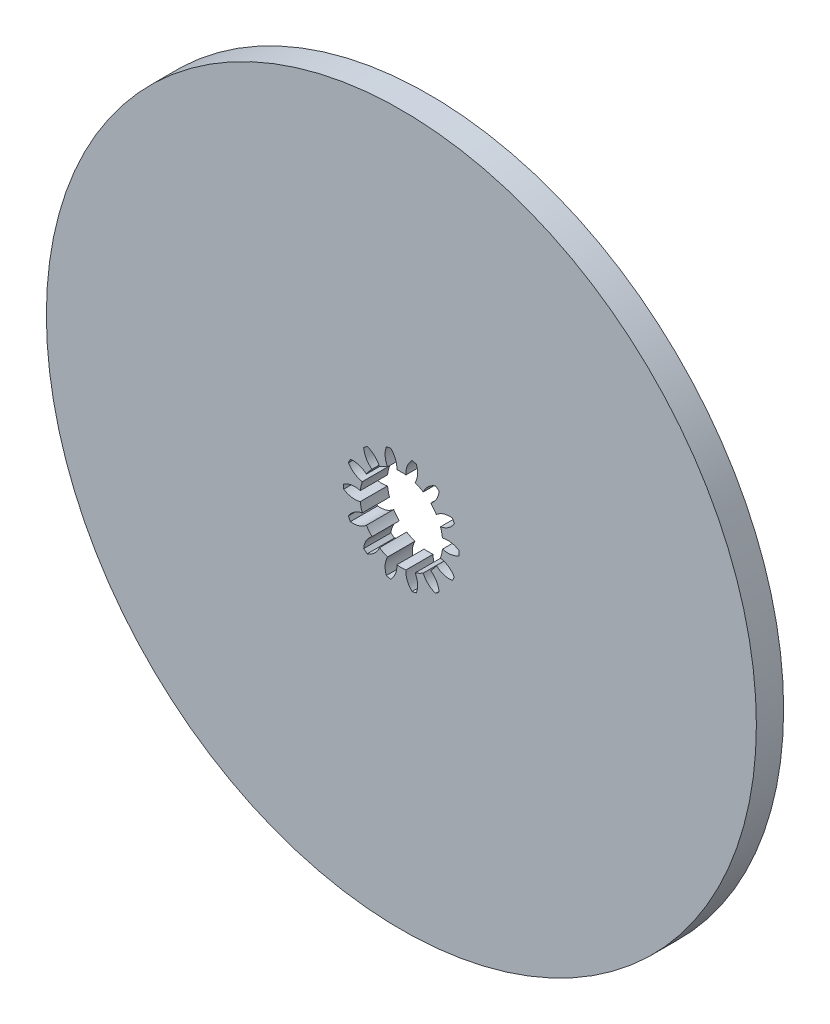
ISO-10303-21;
HEADER;
FILE_DESCRIPTION(('STEP AP214'),'2;1');
FILE_NAME('part.step','',(''),(''),'','','');
FILE_SCHEMA(('AUTOMOTIVE_DESIGN { 1 0 10303 214 1 1 1 1 }'));
ENDSEC;
DATA;
#1=APPLICATION_CONTEXT('core data for automotive mechanical design processes');
#2=APPLICATION_PROTOCOL_DEFINITION('international standard','automotive_design',2000,#1);
#3=PRODUCT_CONTEXT('',#1,'mechanical');
#4=PRODUCT('Part','Part','',(#3));
#5=PRODUCT_RELATED_PRODUCT_CATEGORY('part','',(#4));
#6=PRODUCT_DEFINITION_FORMATION('','',#4);
#7=PRODUCT_DEFINITION_CONTEXT('part definition',#1,'design');
#8=PRODUCT_DEFINITION('design','',#6,#7);
#9=PRODUCT_DEFINITION_SHAPE('','',#8);
#10=(LENGTH_UNIT() NAMED_UNIT(*) SI_UNIT(.MILLI.,.METRE.));
#11=(NAMED_UNIT(*) PLANE_ANGLE_UNIT() SI_UNIT($,.RADIAN.));
#12=(NAMED_UNIT(*) SI_UNIT($,.STERADIAN.) SOLID_ANGLE_UNIT());
#13=UNCERTAINTY_MEASURE_WITH_UNIT(LENGTH_MEASURE(1.E-05),#10,'distance_accuracy_value','');
#14=(GEOMETRIC_REPRESENTATION_CONTEXT(3) GLOBAL_UNCERTAINTY_ASSIGNED_CONTEXT((#13)) GLOBAL_UNIT_ASSIGNED_CONTEXT((#10,
#11,#12)) REPRESENTATION_CONTEXT('',''));
#15=CARTESIAN_POINT('',(0.,0.,0.));
#16=DIRECTION('',(0.,0.,1.));
#17=DIRECTION('',(1.,0.,0.));
#18=AXIS2_PLACEMENT_3D('',#15,#16,#17);
#19=CARTESIAN_POINT('',(0.,0.,-3.));
#20=DIRECTION('',(0.,0.,1.));
#21=DIRECTION('',(1.,0.,0.));
#22=AXIS2_PLACEMENT_3D('',#19,#20,#21);
#23=CYLINDRICAL_SURFACE('',#22,39.06);
#24=CARTESIAN_POINT('',(0.,0.,-3.));
#25=DIRECTION('',(0.,0.,1.));
#26=DIRECTION('',(1.,0.,0.));
#27=AXIS2_PLACEMENT_3D('',#24,#25,#26);
#28=CIRCLE('',#27,39.06);
#29=CARTESIAN_POINT('',(39.06,0.,-3.));
#30=VERTEX_POINT('',#29);
#31=EDGE_CURVE('E11',#30,#30,#28,.T.);
#32=ORIENTED_EDGE('',*,*,#31,.T.);
#33=EDGE_LOOP('',(#32));
#34=FACE_BOUND('',#33,.T.);
#35=CARTESIAN_POINT('',(0.,0.,0.));
#36=DIRECTION('',(0.,0.,1.));
#37=DIRECTION('',(1.,0.,0.));
#38=AXIS2_PLACEMENT_3D('',#35,#36,#37);
#39=CIRCLE('',#38,39.06);
#40=CARTESIAN_POINT('',(39.06,0.,0.));
#41=VERTEX_POINT('',#40);
#42=EDGE_CURVE('E38',#41,#41,#39,.T.);
#43=ORIENTED_EDGE('',*,*,#42,.F.);
#44=EDGE_LOOP('',(#43));
#45=FACE_BOUND('',#44,.T.);
#46=ADVANCED_FACE('F35',(#34,#45),#23,.T.);
#47=CARTESIAN_POINT('',(0.,0.,-3.));
#48=DIRECTION('',(0.,0.,1.));
#49=DIRECTION('',(1.,0.,0.));
#50=AXIS2_PLACEMENT_3D('',#47,#48,#49);
#51=PLANE('',#50);
#52=CARTESIAN_POINT('',(1.93682287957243,-5.01849244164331,-3.));
#53=DIRECTION('',(0.,0.,1.));
#54=DIRECTION('',(1.,0.,0.));
#55=AXIS2_PLACEMENT_3D('',#52,#53,#54);
#56=CIRCLE('',#55,2.2225);
#57=CARTESIAN_POINT('',(4.14922877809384,-4.80691174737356,-3.));
#58=VERTEX_POINT('',#57);
#59=CARTESIAN_POINT('',(3.2287542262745,-3.21006228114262,-3.));
#60=VERTEX_POINT('',#59);
#61=EDGE_CURVE('E395',#58,#60,#56,.T.);
#62=ORIENTED_EDGE('',*,*,#61,.T.);
#63=CARTESIAN_POINT('',(0.,0.,-3.));
#64=DIRECTION('',(0.,0.,1.));
#65=DIRECTION('',(1.,0.,0.));
#66=AXIS2_PLACEMENT_3D('',#63,#64,#65);
#67=CIRCLE('',#66,4.55295);
#68=CARTESIAN_POINT('',(3.84804472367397,-2.43349655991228,-3.));
#69=VERTEX_POINT('',#68);
#70=EDGE_CURVE('E389',#60,#69,#67,.T.);
#71=ORIENTED_EDGE('',*,*,#70,.T.);
#72=CARTESIAN_POINT('',(5.32365199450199,-0.771543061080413,-3.));
#73=DIRECTION('',(0.,0.,1.));
#74=DIRECTION('',(1.,0.,0.));
#75=AXIS2_PLACEMENT_3D('',#72,#73,#74);
#76=CIRCLE('',#75,2.2225);
#77=CARTESIAN_POINT('',(5.60968269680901,-2.97556045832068,-3.));
#78=VERTEX_POINT('',#77);
#79=EDGE_CURVE('E398',#69,#78,#76,.T.);
#80=ORIENTED_EDGE('',*,*,#79,.T.);
#81=CARTESIAN_POINT('',(0.,0.,-3.));
#82=DIRECTION('',(0.,0.,1.));
#83=DIRECTION('',(1.,0.,0.));
#84=AXIS2_PLACEMENT_3D('',#81,#82,#83);
#85=CIRCLE('',#84,6.35);
#86=CARTESIAN_POINT('',(5.8239667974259,-2.53059493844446,-3.));
#87=VERTEX_POINT('',#86);
#88=EDGE_CURVE('E49',#78,#87,#85,.T.);
#89=ORIENTED_EDGE('',*,*,#88,.T.);
#90=CARTESIAN_POINT('',(3.92245938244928,-3.6811495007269,-3.));
#91=DIRECTION('',(0.,0.,1.));
#92=DIRECTION('',(1.,0.,0.));
#93=AXIS2_PLACEMENT_3D('',#90,#91,#92);
#94=CIRCLE('',#93,2.2225);
#95=CARTESIAN_POINT('',(4.30180086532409,-1.49126222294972,-3.));
#96=VERTEX_POINT('',#95);
#97=EDGE_CURVE('E413',#87,#96,#94,.T.);
#98=ORIENTED_EDGE('',*,*,#97,.T.);
#99=CARTESIAN_POINT('',(0.,0.,-3.));
#100=DIRECTION('',(0.,0.,1.));
#101=DIRECTION('',(1.,0.,0.));
#102=AXIS2_PLACEMENT_3D('',#99,#100,#101);
#103=CIRCLE('',#102,4.55295);
#104=CARTESIAN_POINT('',(4.52282308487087,-0.522900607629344,-3.));
#105=VERTEX_POINT('',#104);
#106=EDGE_CURVE('E416',#96,#105,#103,.T.);
#107=ORIENTED_EDGE('',*,*,#106,.T.);
#108=CARTESIAN_POINT('',(5.13120469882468,1.61470975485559,-3.));
#109=DIRECTION('',(0.,0.,1.));
#110=DIRECTION('',(1.,0.,0.));
#111=AXIS2_PLACEMENT_3D('',#108,#109,#110);
#112=CIRCLE('',#111,2.2225);
#113=CARTESIAN_POINT('',(6.34519676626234,-0.246937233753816,-3.));
#114=VERTEX_POINT('',#113);
#115=EDGE_CURVE('E419',#105,#114,#112,.T.);
#116=ORIENTED_EDGE('',*,*,#115,.T.);
#117=CARTESIAN_POINT('',(0.,0.,-3.));
#118=DIRECTION('',(0.,0.,1.));
#119=DIRECTION('',(1.,0.,0.));
#120=AXIS2_PLACEMENT_3D('',#117,#118,#119);
#121=CIRCLE('',#120,6.35);
#122=CARTESIAN_POINT('',(6.34519676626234,0.246937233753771,-3.));
#123=VERTEX_POINT('',#122);
#124=EDGE_CURVE('E422',#114,#123,#121,.T.);
#125=ORIENTED_EDGE('',*,*,#124,.T.);
#126=CARTESIAN_POINT('',(5.13120469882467,-1.61470975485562,-3.));
#127=DIRECTION('',(0.,0.,1.));
#128=DIRECTION('',(1.,0.,0.));
#129=AXIS2_PLACEMENT_3D('',#126,#127,#128);
#130=CIRCLE('',#129,2.2225);
#131=CARTESIAN_POINT('',(4.52282308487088,0.522900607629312,-3.));
#132=VERTEX_POINT('',#131);
#133=EDGE_CURVE('E425',#123,#132,#130,.T.);
#134=ORIENTED_EDGE('',*,*,#133,.T.);
#135=CARTESIAN_POINT('',(0.,0.,-3.));
#136=DIRECTION('',(0.,0.,1.));
#137=DIRECTION('',(1.,0.,0.));
#138=AXIS2_PLACEMENT_3D('',#135,#136,#137);
#139=CIRCLE('',#138,4.55295);
#140=CARTESIAN_POINT('',(4.3018008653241,1.49126222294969,-3.));
#141=VERTEX_POINT('',#140);
#142=EDGE_CURVE('E428',#132,#141,#139,.T.);
#143=ORIENTED_EDGE('',*,*,#142,.T.);
#144=CARTESIAN_POINT('',(3.92245938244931,3.68114950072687,-3.));
#145=DIRECTION('',(0.,0.,1.));
#146=DIRECTION('',(1.,0.,0.));
#147=AXIS2_PLACEMENT_3D('',#144,#145,#146);
#148=CIRCLE('',#147,2.2225);
#149=CARTESIAN_POINT('',(5.82396679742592,2.53059493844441,-3.));
#150=VERTEX_POINT('',#149);
#151=EDGE_CURVE('E431',#141,#150,#148,.T.);
#152=ORIENTED_EDGE('',*,*,#151,.T.);
#153=CARTESIAN_POINT('',(0.,0.,-3.));
#154=DIRECTION('',(0.,0.,1.));
#155=DIRECTION('',(1.,0.,0.));
#156=AXIS2_PLACEMENT_3D('',#153,#154,#155);
#157=CIRCLE('',#156,6.35);
#158=CARTESIAN_POINT('',(5.60968269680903,2.97556045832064,-3.));
#159=VERTEX_POINT('',#158);
#160=EDGE_CURVE('E434',#150,#159,#157,.T.);
#161=ORIENTED_EDGE('',*,*,#160,.T.);
#162=CARTESIAN_POINT('',(5.32365199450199,0.771543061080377,-3.));
#163=DIRECTION('',(0.,0.,1.));
#164=DIRECTION('',(1.,0.,0.));
#165=AXIS2_PLACEMENT_3D('',#162,#163,#164);
#166=CIRCLE('',#165,2.2225);
#167=CARTESIAN_POINT('',(3.84804472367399,2.43349655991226,-3.));
#168=VERTEX_POINT('',#167);
#169=EDGE_CURVE('E437',#159,#168,#166,.T.);
#170=ORIENTED_EDGE('',*,*,#169,.T.);
#171=CARTESIAN_POINT('',(0.,0.,-3.));
#172=DIRECTION('',(0.,0.,1.));
#173=DIRECTION('',(1.,0.,0.));
#174=AXIS2_PLACEMENT_3D('',#171,#172,#173);
#175=CIRCLE('',#174,4.55295);
#176=CARTESIAN_POINT('',(3.22875422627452,3.2100622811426,-3.));
#177=VERTEX_POINT('',#176);
#178=EDGE_CURVE('E440',#168,#177,#175,.T.);
#179=ORIENTED_EDGE('',*,*,#178,.T.);
#180=CARTESIAN_POINT('',(1.93682287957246,5.0184924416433,-3.));
#181=DIRECTION('',(0.,0.,1.));
#182=DIRECTION('',(1.,0.,0.));
#183=AXIS2_PLACEMENT_3D('',#180,#181,#182);
#184=CIRCLE('',#183,2.2225);
#185=CARTESIAN_POINT('',(4.14922877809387,4.80691174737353,-3.));
#186=VERTEX_POINT('',#185);
#187=EDGE_CURVE('E443',#177,#186,#184,.T.);
#188=ORIENTED_EDGE('',*,*,#187,.T.);
#189=CARTESIAN_POINT('',(0.,0.,-3.));
#190=DIRECTION('',(0.,0.,1.));
#191=DIRECTION('',(1.,0.,0.));
#192=AXIS2_PLACEMENT_3D('',#189,#190,#191);
#193=CIRCLE('',#192,6.35);
#194=CARTESIAN_POINT('',(3.76310217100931,5.11483744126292,-3.));
#195=VERTEX_POINT('',#194);
#196=EDGE_CURVE('E446',#186,#195,#193,.T.);
#197=ORIENTED_EDGE('',*,*,#196,.T.);
#198=CARTESIAN_POINT('',(4.46168472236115,3.00498231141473,-3.));
#199=DIRECTION('',(0.,0.,1.));
#200=DIRECTION('',(1.,0.,0.));
#201=AXIS2_PLACEMENT_3D('',#198,#199,#200);
#202=CIRCLE('',#201,2.2225);
#203=CARTESIAN_POINT('',(2.41111391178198,3.86210867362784,-3.));
#204=VERTEX_POINT('',#203);
#205=EDGE_CURVE('E449',#195,#204,#202,.T.);
#206=ORIENTED_EDGE('',*,*,#205,.T.);
#207=CARTESIAN_POINT('',(0.,0.,-3.));
#208=DIRECTION('',(0.,0.,1.));
#209=DIRECTION('',(1.,0.,0.));
#210=AXIS2_PLACEMENT_3D('',#207,#208,#209);
#211=CIRCLE('',#210,4.55295);
#212=CARTESIAN_POINT('',(1.51621321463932,4.29307013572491,-3.));
#213=VERTEX_POINT('',#212);
#214=EDGE_CURVE('E452',#204,#213,#211,.T.);
#215=ORIENTED_EDGE('',*,*,#214,.T.);
#216=CARTESIAN_POINT('',(-0.432425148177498,5.36186140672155,-3.));
#217=DIRECTION('',(0.,0.,1.));
#218=DIRECTION('',(1.,0.,0.));
#219=AXIS2_PLACEMENT_3D('',#216,#217,#218);
#220=CIRCLE('',#219,2.2225);
#221=CARTESIAN_POINT('',(1.65268511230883,6.13116073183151,-3.));
#222=VERTEX_POINT('',#221);
#223=EDGE_CURVE('E455',#213,#222,#220,.T.);
#224=ORIENTED_EDGE('',*,*,#223,.T.);
#225=CARTESIAN_POINT('',(0.,0.,-3.));
#226=DIRECTION('',(0.,0.,1.));
#227=DIRECTION('',(1.,0.,0.));
#228=AXIS2_PLACEMENT_3D('',#225,#226,#227);
#229=CIRCLE('',#228,6.35);
#230=CARTESIAN_POINT('',(1.17119310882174,6.24105813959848,-3.));
#231=VERTEX_POINT('',#230);
#232=EDGE_CURVE('E458',#222,#231,#229,.T.);
#233=ORIENTED_EDGE('',*,*,#232,.T.);
#234=CARTESIAN_POINT('',(2.7160260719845,4.64324796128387,-3.));
#235=DIRECTION('',(0.,0.,1.));
#236=DIRECTION('',(1.,0.,0.));
#237=AXIS2_PLACEMENT_3D('',#234,#235,#236);
#238=CIRCLE('',#237,2.2225);
#239=CARTESIAN_POINT('',(0.49663241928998,4.52578279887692,-3.));
#240=VERTEX_POINT('',#239);
#241=EDGE_CURVE('E461',#231,#240,#238,.T.);
#242=ORIENTED_EDGE('',*,*,#241,.T.);
#243=CARTESIAN_POINT('',(0.,0.,-3.));
#244=DIRECTION('',(0.,0.,1.));
#245=DIRECTION('',(1.,0.,0.));
#246=AXIS2_PLACEMENT_3D('',#243,#244,#245);
#247=CIRCLE('',#246,4.55295);
#248=CARTESIAN_POINT('',(-0.496632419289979,4.52578279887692,-3.));
#249=VERTEX_POINT('',#248);
#250=EDGE_CURVE('E464',#240,#249,#247,.T.);
#251=ORIENTED_EDGE('',*,*,#250,.T.);
#252=CARTESIAN_POINT('',(-2.7160260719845,4.64324796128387,-3.));
#253=DIRECTION('',(0.,0.,1.));
#254=DIRECTION('',(1.,0.,0.));
#255=AXIS2_PLACEMENT_3D('',#252,#253,#254);
#256=CIRCLE('',#255,2.2225);
#257=CARTESIAN_POINT('',(-1.17119310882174,6.24105813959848,-3.));
#258=VERTEX_POINT('',#257);
#259=EDGE_CURVE('E467',#249,#258,#256,.T.);
#260=ORIENTED_EDGE('',*,*,#259,.T.);
#261=CARTESIAN_POINT('',(0.,0.,-3.));
#262=DIRECTION('',(0.,0.,1.));
#263=DIRECTION('',(1.,0.,0.));
#264=AXIS2_PLACEMENT_3D('',#261,#262,#263);
#265=CIRCLE('',#264,6.35);
#266=CARTESIAN_POINT('',(-1.65268511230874,6.13116073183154,-3.));
#267=VERTEX_POINT('',#266);
#268=EDGE_CURVE('E470',#258,#267,#265,.T.);
#269=ORIENTED_EDGE('',*,*,#268,.T.);
#270=CARTESIAN_POINT('',(0.432425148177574,5.36186140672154,-3.));
#271=DIRECTION('',(0.,0.,1.));
#272=DIRECTION('',(1.,0.,0.));
#273=AXIS2_PLACEMENT_3D('',#270,#271,#272);
#274=CIRCLE('',#273,2.2225);
#275=CARTESIAN_POINT('',(-1.51621321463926,4.29307013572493,-3.));
#276=VERTEX_POINT('',#275);
#277=EDGE_CURVE('E473',#267,#276,#274,.T.);
#278=ORIENTED_EDGE('',*,*,#277,.T.);
#279=CARTESIAN_POINT('',(0.,0.,-3.));
#280=DIRECTION('',(0.,0.,1.));
#281=DIRECTION('',(1.,0.,0.));
#282=AXIS2_PLACEMENT_3D('',#279,#280,#281);
#283=CIRCLE('',#282,4.55295);
#284=CARTESIAN_POINT('',(-2.41111391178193,3.86210867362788,-3.));
#285=VERTEX_POINT('',#284);
#286=EDGE_CURVE('E476',#276,#285,#283,.T.);
#287=ORIENTED_EDGE('',*,*,#286,.T.);
#288=CARTESIAN_POINT('',(-4.46168472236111,3.00498231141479,-3.));
#289=DIRECTION('',(0.,0.,1.));
#290=DIRECTION('',(1.,0.,0.));
#291=AXIS2_PLACEMENT_3D('',#288,#289,#290);
#292=CIRCLE('',#291,2.2225);
#293=CARTESIAN_POINT('',(-3.76310217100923,5.11483744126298,-3.));
#294=VERTEX_POINT('',#293);
#295=EDGE_CURVE('E479',#285,#294,#292,.T.);
#296=ORIENTED_EDGE('',*,*,#295,.T.);
#297=CARTESIAN_POINT('',(0.,0.,-3.));
#298=DIRECTION('',(0.,0.,1.));
#299=DIRECTION('',(1.,0.,0.));
#300=AXIS2_PLACEMENT_3D('',#297,#298,#299);
#301=CIRCLE('',#300,6.35);
#302=CARTESIAN_POINT('',(-4.1492287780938,4.80691174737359,-3.));
#303=VERTEX_POINT('',#302);
#304=EDGE_CURVE('E482',#294,#303,#301,.T.);
#305=ORIENTED_EDGE('',*,*,#304,.T.);
#306=CARTESIAN_POINT('',(-1.93682287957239,5.01849244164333,-3.));
#307=DIRECTION('',(0.,0.,1.));
#308=DIRECTION('',(1.,0.,0.));
#309=AXIS2_PLACEMENT_3D('',#306,#307,#308);
#310=CIRCLE('',#309,2.2225);
#311=CARTESIAN_POINT('',(-3.22875422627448,3.21006228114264,-3.));
#312=VERTEX_POINT('',#311);
#313=EDGE_CURVE('E485',#303,#312,#310,.T.);
#314=ORIENTED_EDGE('',*,*,#313,.T.);
#315=CARTESIAN_POINT('',(0.,0.,-3.));
#316=DIRECTION('',(0.,0.,1.));
#317=DIRECTION('',(1.,0.,0.));
#318=AXIS2_PLACEMENT_3D('',#315,#316,#317);
#319=CIRCLE('',#318,4.55295);
#320=CARTESIAN_POINT('',(-3.84804472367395,2.43349655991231,-3.));
#321=VERTEX_POINT('',#320);
#322=EDGE_CURVE('E488',#312,#321,#319,.T.);
#323=ORIENTED_EDGE('',*,*,#322,.T.);
#324=CARTESIAN_POINT('',(-5.32365199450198,0.771543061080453,-3.));
#325=DIRECTION('',(0.,0.,1.));
#326=DIRECTION('',(1.,0.,0.));
#327=AXIS2_PLACEMENT_3D('',#324,#325,#326);
#328=CIRCLE('',#327,2.2225);
#329=CARTESIAN_POINT('',(-5.60968269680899,2.97556045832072,-3.));
#330=VERTEX_POINT('',#329);
#331=EDGE_CURVE('E491',#321,#330,#328,.T.);
#332=ORIENTED_EDGE('',*,*,#331,.T.);
#333=CARTESIAN_POINT('',(0.,0.,-3.));
#334=DIRECTION('',(0.,0.,1.));
#335=DIRECTION('',(1.,0.,0.));
#336=AXIS2_PLACEMENT_3D('',#333,#334,#335);
#337=CIRCLE('',#336,6.35);
#338=CARTESIAN_POINT('',(-5.82396679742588,2.53059493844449,-3.));
#339=VERTEX_POINT('',#338);
#340=EDGE_CURVE('E494',#330,#339,#337,.T.);
#341=ORIENTED_EDGE('',*,*,#340,.T.);
#342=CARTESIAN_POINT('',(-3.92245938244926,3.68114950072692,-3.));
#343=DIRECTION('',(0.,0.,1.));
#344=DIRECTION('',(1.,0.,0.));
#345=AXIS2_PLACEMENT_3D('',#342,#343,#344);
#346=CIRCLE('',#345,2.2225);
#347=CARTESIAN_POINT('',(-4.30180086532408,1.49126222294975,-3.));
#348=VERTEX_POINT('',#347);
#349=EDGE_CURVE('E497',#339,#348,#346,.T.);
#350=ORIENTED_EDGE('',*,*,#349,.T.);
#351=CARTESIAN_POINT('',(0.,0.,-3.));
#352=DIRECTION('',(0.,0.,1.));
#353=DIRECTION('',(1.,0.,0.));
#354=AXIS2_PLACEMENT_3D('',#351,#352,#353);
#355=CIRCLE('',#354,4.55295);
#356=CARTESIAN_POINT('',(-4.52282308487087,0.522900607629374,-3.));
#357=VERTEX_POINT('',#356);
#358=EDGE_CURVE('E500',#348,#357,#355,.T.);
#359=ORIENTED_EDGE('',*,*,#358,.T.);
#360=CARTESIAN_POINT('',(-5.13120469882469,-1.61470975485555,-3.));
#361=DIRECTION('',(0.,0.,1.));
#362=DIRECTION('',(1.,0.,0.));
#363=AXIS2_PLACEMENT_3D('',#360,#361,#362);
#364=CIRCLE('',#363,2.2225);
#365=CARTESIAN_POINT('',(-6.34519676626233,0.246937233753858,-3.));
#366=VERTEX_POINT('',#365);
#367=EDGE_CURVE('E503',#357,#366,#364,.T.);
#368=ORIENTED_EDGE('',*,*,#367,.T.);
#369=CARTESIAN_POINT('',(0.,0.,-3.));
#370=DIRECTION('',(0.,0.,1.));
#371=DIRECTION('',(1.,0.,0.));
#372=AXIS2_PLACEMENT_3D('',#369,#370,#371);
#373=CIRCLE('',#372,6.35);
#374=CARTESIAN_POINT('',(-6.34519676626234,-0.246937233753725,-3.));
#375=VERTEX_POINT('',#374);
#376=EDGE_CURVE('E506',#366,#375,#373,.T.);
#377=ORIENTED_EDGE('',*,*,#376,.T.);
#378=CARTESIAN_POINT('',(-5.13120469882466,1.61470975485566,-3.));
#379=DIRECTION('',(0.,0.,1.));
#380=DIRECTION('',(1.,0.,0.));
#381=AXIS2_PLACEMENT_3D('',#378,#379,#380);
#382=CIRCLE('',#381,2.2225);
#383=CARTESIAN_POINT('',(-4.52282308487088,-0.522900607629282,-3.));
#384=VERTEX_POINT('',#383);
#385=EDGE_CURVE('E509',#375,#384,#382,.T.);
#386=ORIENTED_EDGE('',*,*,#385,.T.);
#387=CARTESIAN_POINT('',(0.,0.,-3.));
#388=DIRECTION('',(0.,0.,1.));
#389=DIRECTION('',(1.,0.,0.));
#390=AXIS2_PLACEMENT_3D('',#387,#388,#389);
#391=CIRCLE('',#390,4.55295);
#392=CARTESIAN_POINT('',(-4.30180086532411,-1.49126222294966,-3.));
#393=VERTEX_POINT('',#392);
#394=EDGE_CURVE('E512',#384,#393,#391,.T.);
#395=ORIENTED_EDGE('',*,*,#394,.T.);
#396=CARTESIAN_POINT('',(-3.92245938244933,-3.68114950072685,-3.));
#397=DIRECTION('',(0.,0.,1.));
#398=DIRECTION('',(1.,0.,0.));
#399=AXIS2_PLACEMENT_3D('',#396,#397,#398);
#400=CIRCLE('',#399,2.2225);
#401=CARTESIAN_POINT('',(-5.82396679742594,-2.53059493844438,-3.));
#402=VERTEX_POINT('',#401);
#403=EDGE_CURVE('E515',#393,#402,#400,.T.);
#404=ORIENTED_EDGE('',*,*,#403,.T.);
#405=CARTESIAN_POINT('',(0.,0.,-3.));
#406=DIRECTION('',(0.,0.,1.));
#407=DIRECTION('',(1.,0.,0.));
#408=AXIS2_PLACEMENT_3D('',#405,#406,#407);
#409=CIRCLE('',#408,6.35);
#410=CARTESIAN_POINT('',(-5.60968269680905,-2.9755604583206,-3.));
#411=VERTEX_POINT('',#410);
#412=EDGE_CURVE('E518',#402,#411,#409,.T.);
#413=ORIENTED_EDGE('',*,*,#412,.T.);
#414=CARTESIAN_POINT('',(-5.323651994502,-0.771543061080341,-3.));
#415=DIRECTION('',(0.,0.,1.));
#416=DIRECTION('',(1.,0.,0.));
#417=AXIS2_PLACEMENT_3D('',#414,#415,#416);
#418=CIRCLE('',#417,2.2225);
#419=CARTESIAN_POINT('',(-3.848044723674,-2.43349655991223,-3.));
#420=VERTEX_POINT('',#419);
#421=EDGE_CURVE('E521',#411,#420,#418,.T.);
#422=ORIENTED_EDGE('',*,*,#421,.T.);
#423=CARTESIAN_POINT('',(0.,0.,-3.));
#424=DIRECTION('',(0.,0.,1.));
#425=DIRECTION('',(1.,0.,0.));
#426=AXIS2_PLACEMENT_3D('',#423,#424,#425);
#427=CIRCLE('',#426,4.55295);
#428=CARTESIAN_POINT('',(-3.22875422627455,-3.21006228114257,-3.));
#429=VERTEX_POINT('',#428);
#430=EDGE_CURVE('E524',#420,#429,#427,.T.);
#431=ORIENTED_EDGE('',*,*,#430,.T.);
#432=CARTESIAN_POINT('',(-1.9368228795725,-5.01849244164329,-3.));
#433=DIRECTION('',(0.,0.,1.));
#434=DIRECTION('',(1.,0.,0.));
#435=AXIS2_PLACEMENT_3D('',#432,#433,#434);
#436=CIRCLE('',#435,2.2225);
#437=CARTESIAN_POINT('',(-4.1492287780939,-4.8069117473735,-3.));
#438=VERTEX_POINT('',#437);
#439=EDGE_CURVE('E527',#429,#438,#436,.T.);
#440=ORIENTED_EDGE('',*,*,#439,.T.);
#441=CARTESIAN_POINT('',(0.,0.,-3.));
#442=DIRECTION('',(0.,0.,1.));
#443=DIRECTION('',(1.,0.,0.));
#444=AXIS2_PLACEMENT_3D('',#441,#442,#443);
#445=CIRCLE('',#444,6.35);
#446=CARTESIAN_POINT('',(-3.76310217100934,-5.1148374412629,-3.));
#447=VERTEX_POINT('',#446);
#448=EDGE_CURVE('E530',#438,#447,#445,.T.);
#449=ORIENTED_EDGE('',*,*,#448,.T.);
#450=CARTESIAN_POINT('',(-4.46168472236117,-3.0049823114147,-3.));
#451=DIRECTION('',(0.,0.,1.));
#452=DIRECTION('',(1.,0.,0.));
#453=AXIS2_PLACEMENT_3D('',#450,#451,#452);
#454=CIRCLE('',#453,2.2225);
#455=CARTESIAN_POINT('',(-2.41111391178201,-3.86210867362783,-3.));
#456=VERTEX_POINT('',#455);
#457=EDGE_CURVE('E533',#447,#456,#454,.T.);
#458=ORIENTED_EDGE('',*,*,#457,.T.);
#459=CARTESIAN_POINT('',(0.,0.,-3.));
#460=DIRECTION('',(0.,0.,1.));
#461=DIRECTION('',(1.,0.,0.));
#462=AXIS2_PLACEMENT_3D('',#459,#460,#461);
#463=CIRCLE('',#462,4.55295);
#464=CARTESIAN_POINT('',(-1.51621321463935,-4.2930701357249,-3.));
#465=VERTEX_POINT('',#464);
#466=EDGE_CURVE('E536',#456,#465,#463,.T.);
#467=ORIENTED_EDGE('',*,*,#466,.T.);
#468=CARTESIAN_POINT('',(0.432425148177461,-5.36186140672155,-3.));
#469=DIRECTION('',(0.,0.,1.));
#470=DIRECTION('',(1.,0.,0.));
#471=AXIS2_PLACEMENT_3D('',#468,#469,#470);
#472=CIRCLE('',#471,2.2225);
#473=CARTESIAN_POINT('',(-1.65268511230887,-6.1311607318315,-3.));
#474=VERTEX_POINT('',#473);
#475=EDGE_CURVE('E539',#465,#474,#472,.T.);
#476=ORIENTED_EDGE('',*,*,#475,.T.);
#477=CARTESIAN_POINT('',(0.,0.,-3.));
#478=DIRECTION('',(0.,0.,1.));
#479=DIRECTION('',(1.,0.,0.));
#480=AXIS2_PLACEMENT_3D('',#477,#478,#479);
#481=CIRCLE('',#480,6.35);
#482=CARTESIAN_POINT('',(-1.17119310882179,-6.24105813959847,-3.));
#483=VERTEX_POINT('',#482);
#484=EDGE_CURVE('E542',#474,#483,#481,.T.);
#485=ORIENTED_EDGE('',*,*,#484,.T.);
#486=CARTESIAN_POINT('',(-2.71602607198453,-4.64324796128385,-3.));
#487=DIRECTION('',(0.,0.,1.));
#488=DIRECTION('',(1.,0.,0.));
#489=AXIS2_PLACEMENT_3D('',#486,#487,#488);
#490=CIRCLE('',#489,2.2225);
#491=CARTESIAN_POINT('',(-0.496632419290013,-4.52578279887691,-3.));
#492=VERTEX_POINT('',#491);
#493=EDGE_CURVE('E545',#483,#492,#490,.T.);
#494=ORIENTED_EDGE('',*,*,#493,.T.);
#495=CARTESIAN_POINT('',(0.,0.,-3.));
#496=DIRECTION('',(0.,0.,1.));
#497=DIRECTION('',(1.,0.,0.));
#498=AXIS2_PLACEMENT_3D('',#495,#496,#497);
#499=CIRCLE('',#498,4.55295);
#500=CARTESIAN_POINT('',(0.496632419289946,-4.52578279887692,-3.));
#501=VERTEX_POINT('',#500);
#502=EDGE_CURVE('E548',#492,#501,#499,.T.);
#503=ORIENTED_EDGE('',*,*,#502,.T.);
#504=CARTESIAN_POINT('',(2.71602607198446,-4.64324796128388,-3.));
#505=DIRECTION('',(0.,0.,1.));
#506=DIRECTION('',(1.,0.,0.));
#507=AXIS2_PLACEMENT_3D('',#504,#505,#506);
#508=CIRCLE('',#507,2.2225);
#509=CARTESIAN_POINT('',(1.1711931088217,-6.24105813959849,-3.));
#510=VERTEX_POINT('',#509);
#511=EDGE_CURVE('E551',#501,#510,#508,.T.);
#512=ORIENTED_EDGE('',*,*,#511,.T.);
#513=CARTESIAN_POINT('',(0.,0.,-3.));
#514=DIRECTION('',(0.,0.,1.));
#515=DIRECTION('',(1.,0.,0.));
#516=AXIS2_PLACEMENT_3D('',#513,#514,#515);
#517=CIRCLE('',#516,6.35);
#518=CARTESIAN_POINT('',(1.65268511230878,-6.13116073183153,-3.));
#519=VERTEX_POINT('',#518);
#520=EDGE_CURVE('E554',#510,#519,#517,.T.);
#521=ORIENTED_EDGE('',*,*,#520,.T.);
#522=CARTESIAN_POINT('',(-0.432425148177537,-5.36186140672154,-3.));
#523=DIRECTION('',(0.,0.,1.));
#524=DIRECTION('',(1.,0.,0.));
#525=AXIS2_PLACEMENT_3D('',#522,#523,#524);
#526=CIRCLE('',#525,2.2225);
#527=CARTESIAN_POINT('',(1.51621321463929,-4.29307013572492,-3.));
#528=VERTEX_POINT('',#527);
#529=EDGE_CURVE('E557',#519,#528,#526,.T.);
#530=ORIENTED_EDGE('',*,*,#529,.T.);
#531=CARTESIAN_POINT('',(0.,0.,-3.));
#532=DIRECTION('',(0.,0.,1.));
#533=DIRECTION('',(1.,0.,0.));
#534=AXIS2_PLACEMENT_3D('',#531,#532,#533);
#535=CIRCLE('',#534,4.55295);
#536=CARTESIAN_POINT('',(2.41111391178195,-3.86210867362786,-3.));
#537=VERTEX_POINT('',#536);
#538=EDGE_CURVE('E560',#528,#537,#535,.T.);
#539=ORIENTED_EDGE('',*,*,#538,.T.);
#540=CARTESIAN_POINT('',(4.46168472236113,-3.00498231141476,-3.));
#541=DIRECTION('',(0.,0.,1.));
#542=DIRECTION('',(1.,0.,0.));
#543=AXIS2_PLACEMENT_3D('',#540,#541,#542);
#544=CIRCLE('',#543,2.2225);
#545=CARTESIAN_POINT('',(3.76310217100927,-5.11483744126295,-3.));
#546=VERTEX_POINT('',#545);
#547=EDGE_CURVE('E563',#537,#546,#544,.T.);
#548=ORIENTED_EDGE('',*,*,#547,.T.);
#549=CARTESIAN_POINT('',(0.,0.,-3.));
#550=DIRECTION('',(0.,0.,1.));
#551=DIRECTION('',(1.,0.,0.));
#552=AXIS2_PLACEMENT_3D('',#549,#550,#551);
#553=CIRCLE('',#552,6.35);
#554=EDGE_CURVE('E566',#546,#58,#553,.T.);
#555=ORIENTED_EDGE('',*,*,#554,.T.);
#556=EDGE_LOOP('',(#62,#71,#80,#89,#98,#107,#116,#125,#134,#143,#152,#161,#170,#179,#188,#197,
#206,#215,#224,#233,#242,#251,#260,#269,#278,#287,#296,#305,#314,#323,#332,#341,#350,#359,#368,
#377,#386,#395,#404,#413,#422,#431,#440,#449,#458,#467,#476,#485,#494,#503,#512,#521,#530,#539,
#548,#555));
#557=FACE_BOUND('',#556,.T.);
#558=ORIENTED_EDGE('',*,*,#31,.F.);
#559=EDGE_LOOP('',(#558));
#560=FACE_BOUND('',#559,.T.);
#561=ADVANCED_FACE('F402',(#557,#560),#51,.F.);
#562=CARTESIAN_POINT('',(0.,0.,0.));
#563=DIRECTION('',(0.,0.,1.));
#564=DIRECTION('',(1.,0.,0.));
#565=AXIS2_PLACEMENT_3D('',#562,#563,#564);
#566=PLANE('',#565);
#567=CARTESIAN_POINT('',(0.,0.,0.));
#568=DIRECTION('',(0.,0.,1.));
#569=DIRECTION('',(1.,0.,0.));
#570=AXIS2_PLACEMENT_3D('',#567,#568,#569);
#571=CIRCLE('',#570,4.55295);
#572=CARTESIAN_POINT('',(3.2287542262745,-3.21006228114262,0.));
#573=VERTEX_POINT('',#572);
#574=CARTESIAN_POINT('',(3.84804472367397,-2.43349655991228,0.));
#575=VERTEX_POINT('',#574);
#576=EDGE_CURVE('E57',#573,#575,#571,.T.);
#577=ORIENTED_EDGE('',*,*,#576,.F.);
#578=CARTESIAN_POINT('',(1.93682287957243,-5.01849244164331,0.));
#579=DIRECTION('',(0.,0.,1.));
#580=DIRECTION('',(1.,0.,0.));
#581=AXIS2_PLACEMENT_3D('',#578,#579,#580);
#582=CIRCLE('',#581,2.2225);
#583=CARTESIAN_POINT('',(4.14922877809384,-4.80691174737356,0.));
#584=VERTEX_POINT('',#583);
#585=EDGE_CURVE('E406',#584,#573,#582,.T.);
#586=ORIENTED_EDGE('',*,*,#585,.F.);
#587=CARTESIAN_POINT('',(0.,0.,0.));
#588=DIRECTION('',(0.,0.,1.));
#589=DIRECTION('',(1.,0.,0.));
#590=AXIS2_PLACEMENT_3D('',#587,#588,#589);
#591=CIRCLE('',#590,6.35);
#592=CARTESIAN_POINT('',(3.76310217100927,-5.11483744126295,0.));
#593=VERTEX_POINT('',#592);
#594=EDGE_CURVE('E409',#593,#584,#591,.T.);
#595=ORIENTED_EDGE('',*,*,#594,.F.);
#596=CARTESIAN_POINT('',(4.46168472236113,-3.00498231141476,0.));
#597=DIRECTION('',(0.,0.,1.));
#598=DIRECTION('',(1.,0.,0.));
#599=AXIS2_PLACEMENT_3D('',#596,#597,#598);
#600=CIRCLE('',#599,2.2225);
#601=CARTESIAN_POINT('',(2.41111391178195,-3.86210867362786,0.));
#602=VERTEX_POINT('',#601);
#603=EDGE_CURVE('E725',#602,#593,#600,.T.);
#604=ORIENTED_EDGE('',*,*,#603,.F.);
#605=CARTESIAN_POINT('',(0.,0.,0.));
#606=DIRECTION('',(0.,0.,1.));
#607=DIRECTION('',(1.,0.,0.));
#608=AXIS2_PLACEMENT_3D('',#605,#606,#607);
#609=CIRCLE('',#608,4.55295);
#610=CARTESIAN_POINT('',(1.51621321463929,-4.29307013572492,0.));
#611=VERTEX_POINT('',#610);
#612=EDGE_CURVE('E722',#611,#602,#609,.T.);
#613=ORIENTED_EDGE('',*,*,#612,.F.);
#614=CARTESIAN_POINT('',(-0.432425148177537,-5.36186140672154,0.));
#615=DIRECTION('',(0.,0.,1.));
#616=DIRECTION('',(1.,0.,0.));
#617=AXIS2_PLACEMENT_3D('',#614,#615,#616);
#618=CIRCLE('',#617,2.2225);
#619=CARTESIAN_POINT('',(1.65268511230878,-6.13116073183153,0.));
#620=VERTEX_POINT('',#619);
#621=EDGE_CURVE('E719',#620,#611,#618,.T.);
#622=ORIENTED_EDGE('',*,*,#621,.F.);
#623=CARTESIAN_POINT('',(0.,0.,0.));
#624=DIRECTION('',(0.,0.,1.));
#625=DIRECTION('',(1.,0.,0.));
#626=AXIS2_PLACEMENT_3D('',#623,#624,#625);
#627=CIRCLE('',#626,6.35);
#628=CARTESIAN_POINT('',(1.1711931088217,-6.24105813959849,0.));
#629=VERTEX_POINT('',#628);
#630=EDGE_CURVE('E716',#629,#620,#627,.T.);
#631=ORIENTED_EDGE('',*,*,#630,.F.);
#632=CARTESIAN_POINT('',(2.71602607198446,-4.64324796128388,0.));
#633=DIRECTION('',(0.,0.,1.));
#634=DIRECTION('',(1.,0.,0.));
#635=AXIS2_PLACEMENT_3D('',#632,#633,#634);
#636=CIRCLE('',#635,2.2225);
#637=CARTESIAN_POINT('',(0.496632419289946,-4.52578279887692,0.));
#638=VERTEX_POINT('',#637);
#639=EDGE_CURVE('E713',#638,#629,#636,.T.);
#640=ORIENTED_EDGE('',*,*,#639,.F.);
#641=CARTESIAN_POINT('',(0.,0.,0.));
#642=DIRECTION('',(0.,0.,1.));
#643=DIRECTION('',(1.,0.,0.));
#644=AXIS2_PLACEMENT_3D('',#641,#642,#643);
#645=CIRCLE('',#644,4.55295);
#646=CARTESIAN_POINT('',(-0.496632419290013,-4.52578279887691,0.));
#647=VERTEX_POINT('',#646);
#648=EDGE_CURVE('E710',#647,#638,#645,.T.);
#649=ORIENTED_EDGE('',*,*,#648,.F.);
#650=CARTESIAN_POINT('',(-2.71602607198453,-4.64324796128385,0.));
#651=DIRECTION('',(0.,0.,1.));
#652=DIRECTION('',(1.,0.,0.));
#653=AXIS2_PLACEMENT_3D('',#650,#651,#652);
#654=CIRCLE('',#653,2.2225);
#655=CARTESIAN_POINT('',(-1.17119310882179,-6.24105813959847,0.));
#656=VERTEX_POINT('',#655);
#657=EDGE_CURVE('E707',#656,#647,#654,.T.);
#658=ORIENTED_EDGE('',*,*,#657,.F.);
#659=CARTESIAN_POINT('',(0.,0.,0.));
#660=DIRECTION('',(0.,0.,1.));
#661=DIRECTION('',(1.,0.,0.));
#662=AXIS2_PLACEMENT_3D('',#659,#660,#661);
#663=CIRCLE('',#662,6.35);
#664=CARTESIAN_POINT('',(-1.65268511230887,-6.1311607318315,0.));
#665=VERTEX_POINT('',#664);
#666=EDGE_CURVE('E704',#665,#656,#663,.T.);
#667=ORIENTED_EDGE('',*,*,#666,.F.);
#668=CARTESIAN_POINT('',(0.432425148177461,-5.36186140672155,0.));
#669=DIRECTION('',(0.,0.,1.));
#670=DIRECTION('',(1.,0.,0.));
#671=AXIS2_PLACEMENT_3D('',#668,#669,#670);
#672=CIRCLE('',#671,2.2225);
#673=CARTESIAN_POINT('',(-1.51621321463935,-4.2930701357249,0.));
#674=VERTEX_POINT('',#673);
#675=EDGE_CURVE('E701',#674,#665,#672,.T.);
#676=ORIENTED_EDGE('',*,*,#675,.F.);
#677=CARTESIAN_POINT('',(0.,0.,0.));
#678=DIRECTION('',(0.,0.,1.));
#679=DIRECTION('',(1.,0.,0.));
#680=AXIS2_PLACEMENT_3D('',#677,#678,#679);
#681=CIRCLE('',#680,4.55295);
#682=CARTESIAN_POINT('',(-2.41111391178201,-3.86210867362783,0.));
#683=VERTEX_POINT('',#682);
#684=EDGE_CURVE('E698',#683,#674,#681,.T.);
#685=ORIENTED_EDGE('',*,*,#684,.F.);
#686=CARTESIAN_POINT('',(-4.46168472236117,-3.0049823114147,0.));
#687=DIRECTION('',(0.,0.,1.));
#688=DIRECTION('',(1.,0.,0.));
#689=AXIS2_PLACEMENT_3D('',#686,#687,#688);
#690=CIRCLE('',#689,2.2225);
#691=CARTESIAN_POINT('',(-3.76310217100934,-5.1148374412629,0.));
#692=VERTEX_POINT('',#691);
#693=EDGE_CURVE('E695',#692,#683,#690,.T.);
#694=ORIENTED_EDGE('',*,*,#693,.F.);
#695=CARTESIAN_POINT('',(0.,0.,0.));
#696=DIRECTION('',(0.,0.,1.));
#697=DIRECTION('',(1.,0.,0.));
#698=AXIS2_PLACEMENT_3D('',#695,#696,#697);
#699=CIRCLE('',#698,6.35);
#700=CARTESIAN_POINT('',(-4.1492287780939,-4.8069117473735,0.));
#701=VERTEX_POINT('',#700);
#702=EDGE_CURVE('E692',#701,#692,#699,.T.);
#703=ORIENTED_EDGE('',*,*,#702,.F.);
#704=CARTESIAN_POINT('',(-1.9368228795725,-5.01849244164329,0.));
#705=DIRECTION('',(0.,0.,1.));
#706=DIRECTION('',(1.,0.,0.));
#707=AXIS2_PLACEMENT_3D('',#704,#705,#706);
#708=CIRCLE('',#707,2.2225);
#709=CARTESIAN_POINT('',(-3.22875422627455,-3.21006228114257,0.));
#710=VERTEX_POINT('',#709);
#711=EDGE_CURVE('E689',#710,#701,#708,.T.);
#712=ORIENTED_EDGE('',*,*,#711,.F.);
#713=CARTESIAN_POINT('',(0.,0.,0.));
#714=DIRECTION('',(0.,0.,1.));
#715=DIRECTION('',(1.,0.,0.));
#716=AXIS2_PLACEMENT_3D('',#713,#714,#715);
#717=CIRCLE('',#716,4.55295);
#718=CARTESIAN_POINT('',(-3.848044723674,-2.43349655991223,0.));
#719=VERTEX_POINT('',#718);
#720=EDGE_CURVE('E686',#719,#710,#717,.T.);
#721=ORIENTED_EDGE('',*,*,#720,.F.);
#722=CARTESIAN_POINT('',(-5.323651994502,-0.771543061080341,0.));
#723=DIRECTION('',(0.,0.,1.));
#724=DIRECTION('',(1.,0.,0.));
#725=AXIS2_PLACEMENT_3D('',#722,#723,#724);
#726=CIRCLE('',#725,2.2225);
#727=CARTESIAN_POINT('',(-5.60968269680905,-2.9755604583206,0.));
#728=VERTEX_POINT('',#727);
#729=EDGE_CURVE('E683',#728,#719,#726,.T.);
#730=ORIENTED_EDGE('',*,*,#729,.F.);
#731=CARTESIAN_POINT('',(0.,0.,0.));
#732=DIRECTION('',(0.,0.,1.));
#733=DIRECTION('',(1.,0.,0.));
#734=AXIS2_PLACEMENT_3D('',#731,#732,#733);
#735=CIRCLE('',#734,6.35);
#736=CARTESIAN_POINT('',(-5.82396679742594,-2.53059493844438,0.));
#737=VERTEX_POINT('',#736);
#738=EDGE_CURVE('E680',#737,#728,#735,.T.);
#739=ORIENTED_EDGE('',*,*,#738,.F.);
#740=CARTESIAN_POINT('',(-3.92245938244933,-3.68114950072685,0.));
#741=DIRECTION('',(0.,0.,1.));
#742=DIRECTION('',(1.,0.,0.));
#743=AXIS2_PLACEMENT_3D('',#740,#741,#742);
#744=CIRCLE('',#743,2.2225);
#745=CARTESIAN_POINT('',(-4.30180086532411,-1.49126222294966,0.));
#746=VERTEX_POINT('',#745);
#747=EDGE_CURVE('E677',#746,#737,#744,.T.);
#748=ORIENTED_EDGE('',*,*,#747,.F.);
#749=CARTESIAN_POINT('',(0.,0.,0.));
#750=DIRECTION('',(0.,0.,1.));
#751=DIRECTION('',(1.,0.,0.));
#752=AXIS2_PLACEMENT_3D('',#749,#750,#751);
#753=CIRCLE('',#752,4.55295);
#754=CARTESIAN_POINT('',(-4.52282308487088,-0.522900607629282,0.));
#755=VERTEX_POINT('',#754);
#756=EDGE_CURVE('E674',#755,#746,#753,.T.);
#757=ORIENTED_EDGE('',*,*,#756,.F.);
#758=CARTESIAN_POINT('',(-5.13120469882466,1.61470975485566,0.));
#759=DIRECTION('',(0.,0.,1.));
#760=DIRECTION('',(1.,0.,0.));
#761=AXIS2_PLACEMENT_3D('',#758,#759,#760);
#762=CIRCLE('',#761,2.2225);
#763=CARTESIAN_POINT('',(-6.34519676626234,-0.246937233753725,0.));
#764=VERTEX_POINT('',#763);
#765=EDGE_CURVE('E671',#764,#755,#762,.T.);
#766=ORIENTED_EDGE('',*,*,#765,.F.);
#767=CARTESIAN_POINT('',(0.,0.,0.));
#768=DIRECTION('',(0.,0.,1.));
#769=DIRECTION('',(1.,0.,0.));
#770=AXIS2_PLACEMENT_3D('',#767,#768,#769);
#771=CIRCLE('',#770,6.35);
#772=CARTESIAN_POINT('',(-6.34519676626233,0.246937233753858,0.));
#773=VERTEX_POINT('',#772);
#774=EDGE_CURVE('E668',#773,#764,#771,.T.);
#775=ORIENTED_EDGE('',*,*,#774,.F.);
#776=CARTESIAN_POINT('',(-5.13120469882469,-1.61470975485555,0.));
#777=DIRECTION('',(0.,0.,1.));
#778=DIRECTION('',(1.,0.,0.));
#779=AXIS2_PLACEMENT_3D('',#776,#777,#778);
#780=CIRCLE('',#779,2.2225);
#781=CARTESIAN_POINT('',(-4.52282308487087,0.522900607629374,0.));
#782=VERTEX_POINT('',#781);
#783=EDGE_CURVE('E665',#782,#773,#780,.T.);
#784=ORIENTED_EDGE('',*,*,#783,.F.);
#785=CARTESIAN_POINT('',(0.,0.,0.));
#786=DIRECTION('',(0.,0.,1.));
#787=DIRECTION('',(1.,0.,0.));
#788=AXIS2_PLACEMENT_3D('',#785,#786,#787);
#789=CIRCLE('',#788,4.55295);
#790=CARTESIAN_POINT('',(-4.30180086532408,1.49126222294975,0.));
#791=VERTEX_POINT('',#790);
#792=EDGE_CURVE('E662',#791,#782,#789,.T.);
#793=ORIENTED_EDGE('',*,*,#792,.F.);
#794=CARTESIAN_POINT('',(-3.92245938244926,3.68114950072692,0.));
#795=DIRECTION('',(0.,0.,1.));
#796=DIRECTION('',(1.,0.,0.));
#797=AXIS2_PLACEMENT_3D('',#794,#795,#796);
#798=CIRCLE('',#797,2.2225);
#799=CARTESIAN_POINT('',(-5.82396679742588,2.53059493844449,0.));
#800=VERTEX_POINT('',#799);
#801=EDGE_CURVE('E659',#800,#791,#798,.T.);
#802=ORIENTED_EDGE('',*,*,#801,.F.);
#803=CARTESIAN_POINT('',(0.,0.,0.));
#804=DIRECTION('',(0.,0.,1.));
#805=DIRECTION('',(1.,0.,0.));
#806=AXIS2_PLACEMENT_3D('',#803,#804,#805);
#807=CIRCLE('',#806,6.35);
#808=CARTESIAN_POINT('',(-5.60968269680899,2.97556045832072,0.));
#809=VERTEX_POINT('',#808);
#810=EDGE_CURVE('E656',#809,#800,#807,.T.);
#811=ORIENTED_EDGE('',*,*,#810,.F.);
#812=CARTESIAN_POINT('',(-5.32365199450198,0.771543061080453,0.));
#813=DIRECTION('',(0.,0.,1.));
#814=DIRECTION('',(1.,0.,0.));
#815=AXIS2_PLACEMENT_3D('',#812,#813,#814);
#816=CIRCLE('',#815,2.2225);
#817=CARTESIAN_POINT('',(-3.84804472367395,2.43349655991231,0.));
#818=VERTEX_POINT('',#817);
#819=EDGE_CURVE('E653',#818,#809,#816,.T.);
#820=ORIENTED_EDGE('',*,*,#819,.F.);
#821=CARTESIAN_POINT('',(0.,0.,0.));
#822=DIRECTION('',(0.,0.,1.));
#823=DIRECTION('',(1.,0.,0.));
#824=AXIS2_PLACEMENT_3D('',#821,#822,#823);
#825=CIRCLE('',#824,4.55295);
#826=CARTESIAN_POINT('',(-3.22875422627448,3.21006228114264,0.));
#827=VERTEX_POINT('',#826);
#828=EDGE_CURVE('E650',#827,#818,#825,.T.);
#829=ORIENTED_EDGE('',*,*,#828,.F.);
#830=CARTESIAN_POINT('',(-1.93682287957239,5.01849244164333,0.));
#831=DIRECTION('',(0.,0.,1.));
#832=DIRECTION('',(1.,0.,0.));
#833=AXIS2_PLACEMENT_3D('',#830,#831,#832);
#834=CIRCLE('',#833,2.2225);
#835=CARTESIAN_POINT('',(-4.1492287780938,4.80691174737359,0.));
#836=VERTEX_POINT('',#835);
#837=EDGE_CURVE('E647',#836,#827,#834,.T.);
#838=ORIENTED_EDGE('',*,*,#837,.F.);
#839=CARTESIAN_POINT('',(0.,0.,0.));
#840=DIRECTION('',(0.,0.,1.));
#841=DIRECTION('',(1.,0.,0.));
#842=AXIS2_PLACEMENT_3D('',#839,#840,#841);
#843=CIRCLE('',#842,6.35);
#844=CARTESIAN_POINT('',(-3.76310217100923,5.11483744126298,0.));
#845=VERTEX_POINT('',#844);
#846=EDGE_CURVE('E644',#845,#836,#843,.T.);
#847=ORIENTED_EDGE('',*,*,#846,.F.);
#848=CARTESIAN_POINT('',(-4.46168472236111,3.00498231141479,0.));
#849=DIRECTION('',(0.,0.,1.));
#850=DIRECTION('',(1.,0.,0.));
#851=AXIS2_PLACEMENT_3D('',#848,#849,#850);
#852=CIRCLE('',#851,2.2225);
#853=CARTESIAN_POINT('',(-2.41111391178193,3.86210867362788,0.));
#854=VERTEX_POINT('',#853);
#855=EDGE_CURVE('E641',#854,#845,#852,.T.);
#856=ORIENTED_EDGE('',*,*,#855,.F.);
#857=CARTESIAN_POINT('',(0.,0.,0.));
#858=DIRECTION('',(0.,0.,1.));
#859=DIRECTION('',(1.,0.,0.));
#860=AXIS2_PLACEMENT_3D('',#857,#858,#859);
#861=CIRCLE('',#860,4.55295);
#862=CARTESIAN_POINT('',(-1.51621321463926,4.29307013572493,0.));
#863=VERTEX_POINT('',#862);
#864=EDGE_CURVE('E638',#863,#854,#861,.T.);
#865=ORIENTED_EDGE('',*,*,#864,.F.);
#866=CARTESIAN_POINT('',(0.432425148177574,5.36186140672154,0.));
#867=DIRECTION('',(0.,0.,1.));
#868=DIRECTION('',(1.,0.,0.));
#869=AXIS2_PLACEMENT_3D('',#866,#867,#868);
#870=CIRCLE('',#869,2.2225);
#871=CARTESIAN_POINT('',(-1.65268511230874,6.13116073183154,0.));
#872=VERTEX_POINT('',#871);
#873=EDGE_CURVE('E635',#872,#863,#870,.T.);
#874=ORIENTED_EDGE('',*,*,#873,.F.);
#875=CARTESIAN_POINT('',(0.,0.,0.));
#876=DIRECTION('',(0.,0.,1.));
#877=DIRECTION('',(1.,0.,0.));
#878=AXIS2_PLACEMENT_3D('',#875,#876,#877);
#879=CIRCLE('',#878,6.35);
#880=CARTESIAN_POINT('',(-1.17119310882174,6.24105813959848,0.));
#881=VERTEX_POINT('',#880);
#882=EDGE_CURVE('E632',#881,#872,#879,.T.);
#883=ORIENTED_EDGE('',*,*,#882,.F.);
#884=CARTESIAN_POINT('',(-2.7160260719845,4.64324796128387,0.));
#885=DIRECTION('',(0.,0.,1.));
#886=DIRECTION('',(1.,0.,0.));
#887=AXIS2_PLACEMENT_3D('',#884,#885,#886);
#888=CIRCLE('',#887,2.2225);
#889=CARTESIAN_POINT('',(-0.496632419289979,4.52578279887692,0.));
#890=VERTEX_POINT('',#889);
#891=EDGE_CURVE('E629',#890,#881,#888,.T.);
#892=ORIENTED_EDGE('',*,*,#891,.F.);
#893=CARTESIAN_POINT('',(0.,0.,0.));
#894=DIRECTION('',(0.,0.,1.));
#895=DIRECTION('',(1.,0.,0.));
#896=AXIS2_PLACEMENT_3D('',#893,#894,#895);
#897=CIRCLE('',#896,4.55295);
#898=CARTESIAN_POINT('',(0.49663241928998,4.52578279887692,0.));
#899=VERTEX_POINT('',#898);
#900=EDGE_CURVE('E626',#899,#890,#897,.T.);
#901=ORIENTED_EDGE('',*,*,#900,.F.);
#902=CARTESIAN_POINT('',(2.7160260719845,4.64324796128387,0.));
#903=DIRECTION('',(0.,0.,1.));
#904=DIRECTION('',(1.,0.,0.));
#905=AXIS2_PLACEMENT_3D('',#902,#903,#904);
#906=CIRCLE('',#905,2.2225);
#907=CARTESIAN_POINT('',(1.17119310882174,6.24105813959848,0.));
#908=VERTEX_POINT('',#907);
#909=EDGE_CURVE('E623',#908,#899,#906,.T.);
#910=ORIENTED_EDGE('',*,*,#909,.F.);
#911=CARTESIAN_POINT('',(0.,0.,0.));
#912=DIRECTION('',(0.,0.,1.));
#913=DIRECTION('',(1.,0.,0.));
#914=AXIS2_PLACEMENT_3D('',#911,#912,#913);
#915=CIRCLE('',#914,6.35);
#916=CARTESIAN_POINT('',(1.65268511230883,6.13116073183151,0.));
#917=VERTEX_POINT('',#916);
#918=EDGE_CURVE('E620',#917,#908,#915,.T.);
#919=ORIENTED_EDGE('',*,*,#918,.F.);
#920=CARTESIAN_POINT('',(-0.432425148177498,5.36186140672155,0.));
#921=DIRECTION('',(0.,0.,1.));
#922=DIRECTION('',(1.,0.,0.));
#923=AXIS2_PLACEMENT_3D('',#920,#921,#922);
#924=CIRCLE('',#923,2.2225);
#925=CARTESIAN_POINT('',(1.51621321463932,4.29307013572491,0.));
#926=VERTEX_POINT('',#925);
#927=EDGE_CURVE('E617',#926,#917,#924,.T.);
#928=ORIENTED_EDGE('',*,*,#927,.F.);
#929=CARTESIAN_POINT('',(0.,0.,0.));
#930=DIRECTION('',(0.,0.,1.));
#931=DIRECTION('',(1.,0.,0.));
#932=AXIS2_PLACEMENT_3D('',#929,#930,#931);
#933=CIRCLE('',#932,4.55295);
#934=CARTESIAN_POINT('',(2.41111391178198,3.86210867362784,0.));
#935=VERTEX_POINT('',#934);
#936=EDGE_CURVE('E614',#935,#926,#933,.T.);
#937=ORIENTED_EDGE('',*,*,#936,.F.);
#938=CARTESIAN_POINT('',(4.46168472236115,3.00498231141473,0.));
#939=DIRECTION('',(0.,0.,1.));
#940=DIRECTION('',(1.,0.,0.));
#941=AXIS2_PLACEMENT_3D('',#938,#939,#940);
#942=CIRCLE('',#941,2.2225);
#943=CARTESIAN_POINT('',(3.76310217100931,5.11483744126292,0.));
#944=VERTEX_POINT('',#943);
#945=EDGE_CURVE('E611',#944,#935,#942,.T.);
#946=ORIENTED_EDGE('',*,*,#945,.F.);
#947=CARTESIAN_POINT('',(0.,0.,0.));
#948=DIRECTION('',(0.,0.,1.));
#949=DIRECTION('',(1.,0.,0.));
#950=AXIS2_PLACEMENT_3D('',#947,#948,#949);
#951=CIRCLE('',#950,6.35);
#952=CARTESIAN_POINT('',(4.14922877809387,4.80691174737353,0.));
#953=VERTEX_POINT('',#952);
#954=EDGE_CURVE('E608',#953,#944,#951,.T.);
#955=ORIENTED_EDGE('',*,*,#954,.F.);
#956=CARTESIAN_POINT('',(1.93682287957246,5.0184924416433,0.));
#957=DIRECTION('',(0.,0.,1.));
#958=DIRECTION('',(1.,0.,0.));
#959=AXIS2_PLACEMENT_3D('',#956,#957,#958);
#960=CIRCLE('',#959,2.2225);
#961=CARTESIAN_POINT('',(3.22875422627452,3.2100622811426,0.));
#962=VERTEX_POINT('',#961);
#963=EDGE_CURVE('E605',#962,#953,#960,.T.);
#964=ORIENTED_EDGE('',*,*,#963,.F.);
#965=CARTESIAN_POINT('',(0.,0.,0.));
#966=DIRECTION('',(0.,0.,1.));
#967=DIRECTION('',(1.,0.,0.));
#968=AXIS2_PLACEMENT_3D('',#965,#966,#967);
#969=CIRCLE('',#968,4.55295);
#970=CARTESIAN_POINT('',(3.84804472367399,2.43349655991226,0.));
#971=VERTEX_POINT('',#970);
#972=EDGE_CURVE('E602',#971,#962,#969,.T.);
#973=ORIENTED_EDGE('',*,*,#972,.F.);
#974=CARTESIAN_POINT('',(5.32365199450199,0.771543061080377,0.));
#975=DIRECTION('',(0.,0.,1.));
#976=DIRECTION('',(1.,0.,0.));
#977=AXIS2_PLACEMENT_3D('',#974,#975,#976);
#978=CIRCLE('',#977,2.2225);
#979=CARTESIAN_POINT('',(5.60968269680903,2.97556045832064,0.));
#980=VERTEX_POINT('',#979);
#981=EDGE_CURVE('E599',#980,#971,#978,.T.);
#982=ORIENTED_EDGE('',*,*,#981,.F.);
#983=CARTESIAN_POINT('',(0.,0.,0.));
#984=DIRECTION('',(0.,0.,1.));
#985=DIRECTION('',(1.,0.,0.));
#986=AXIS2_PLACEMENT_3D('',#983,#984,#985);
#987=CIRCLE('',#986,6.35);
#988=CARTESIAN_POINT('',(5.82396679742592,2.53059493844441,0.));
#989=VERTEX_POINT('',#988);
#990=EDGE_CURVE('E596',#989,#980,#987,.T.);
#991=ORIENTED_EDGE('',*,*,#990,.F.);
#992=CARTESIAN_POINT('',(3.92245938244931,3.68114950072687,0.));
#993=DIRECTION('',(0.,0.,1.));
#994=DIRECTION('',(1.,0.,0.));
#995=AXIS2_PLACEMENT_3D('',#992,#993,#994);
#996=CIRCLE('',#995,2.2225);
#997=CARTESIAN_POINT('',(4.3018008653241,1.49126222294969,0.));
#998=VERTEX_POINT('',#997);
#999=EDGE_CURVE('E593',#998,#989,#996,.T.);
#1000=ORIENTED_EDGE('',*,*,#999,.F.);
#1001=CARTESIAN_POINT('',(0.,0.,0.));
#1002=DIRECTION('',(0.,0.,1.));
#1003=DIRECTION('',(1.,0.,0.));
#1004=AXIS2_PLACEMENT_3D('',#1001,#1002,#1003);
#1005=CIRCLE('',#1004,4.55295);
#1006=CARTESIAN_POINT('',(4.52282308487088,0.522900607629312,0.));
#1007=VERTEX_POINT('',#1006);
#1008=EDGE_CURVE('E590',#1007,#998,#1005,.T.);
#1009=ORIENTED_EDGE('',*,*,#1008,.F.);
#1010=CARTESIAN_POINT('',(5.13120469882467,-1.61470975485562,0.));
#1011=DIRECTION('',(0.,0.,1.));
#1012=DIRECTION('',(1.,0.,0.));
#1013=AXIS2_PLACEMENT_3D('',#1010,#1011,#1012);
#1014=CIRCLE('',#1013,2.2225);
#1015=CARTESIAN_POINT('',(6.34519676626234,0.246937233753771,0.));
#1016=VERTEX_POINT('',#1015);
#1017=EDGE_CURVE('E587',#1016,#1007,#1014,.T.);
#1018=ORIENTED_EDGE('',*,*,#1017,.F.);
#1019=CARTESIAN_POINT('',(0.,0.,0.));
#1020=DIRECTION('',(0.,0.,1.));
#1021=DIRECTION('',(1.,0.,0.));
#1022=AXIS2_PLACEMENT_3D('',#1019,#1020,#1021);
#1023=CIRCLE('',#1022,6.35);
#1024=CARTESIAN_POINT('',(6.34519676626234,-0.246937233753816,0.));
#1025=VERTEX_POINT('',#1024);
#1026=EDGE_CURVE('E584',#1025,#1016,#1023,.T.);
#1027=ORIENTED_EDGE('',*,*,#1026,.F.);
#1028=CARTESIAN_POINT('',(5.13120469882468,1.61470975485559,0.));
#1029=DIRECTION('',(0.,0.,1.));
#1030=DIRECTION('',(1.,0.,0.));
#1031=AXIS2_PLACEMENT_3D('',#1028,#1029,#1030);
#1032=CIRCLE('',#1031,2.2225);
#1033=CARTESIAN_POINT('',(4.52282308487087,-0.522900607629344,0.));
#1034=VERTEX_POINT('',#1033);
#1035=EDGE_CURVE('E581',#1034,#1025,#1032,.T.);
#1036=ORIENTED_EDGE('',*,*,#1035,.F.);
#1037=CARTESIAN_POINT('',(0.,0.,0.));
#1038=DIRECTION('',(0.,0.,1.));
#1039=DIRECTION('',(1.,0.,0.));
#1040=AXIS2_PLACEMENT_3D('',#1037,#1038,#1039);
#1041=CIRCLE('',#1040,4.55295);
#1042=CARTESIAN_POINT('',(4.30180086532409,-1.49126222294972,0.));
#1043=VERTEX_POINT('',#1042);
#1044=EDGE_CURVE('E578',#1043,#1034,#1041,.T.);
#1045=ORIENTED_EDGE('',*,*,#1044,.F.);
#1046=CARTESIAN_POINT('',(3.92245938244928,-3.6811495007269,0.));
#1047=DIRECTION('',(0.,0.,1.));
#1048=DIRECTION('',(1.,0.,0.));
#1049=AXIS2_PLACEMENT_3D('',#1046,#1047,#1048);
#1050=CIRCLE('',#1049,2.2225);
#1051=CARTESIAN_POINT('',(5.8239667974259,-2.53059493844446,0.));
#1052=VERTEX_POINT('',#1051);
#1053=EDGE_CURVE('E575',#1052,#1043,#1050,.T.);
#1054=ORIENTED_EDGE('',*,*,#1053,.F.);
#1055=CARTESIAN_POINT('',(0.,0.,0.));
#1056=DIRECTION('',(0.,0.,1.));
#1057=DIRECTION('',(1.,0.,0.));
#1058=AXIS2_PLACEMENT_3D('',#1055,#1056,#1057);
#1059=CIRCLE('',#1058,6.35);
#1060=CARTESIAN_POINT('',(5.60968269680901,-2.97556045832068,0.));
#1061=VERTEX_POINT('',#1060);
#1062=EDGE_CURVE('E572',#1061,#1052,#1059,.T.);
#1063=ORIENTED_EDGE('',*,*,#1062,.F.);
#1064=CARTESIAN_POINT('',(5.32365199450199,-0.771543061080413,0.));
#1065=DIRECTION('',(0.,0.,1.));
#1066=DIRECTION('',(1.,0.,0.));
#1067=AXIS2_PLACEMENT_3D('',#1064,#1065,#1066);
#1068=CIRCLE('',#1067,2.2225);
#1069=EDGE_CURVE('E570',#575,#1061,#1068,.T.);
#1070=ORIENTED_EDGE('',*,*,#1069,.F.);
#1071=EDGE_LOOP('',(#577,#586,#595,#604,#613,#622,#631,#640,#649,#658,#667,#676,#685,#694,#703,
#712,#721,#730,#739,#748,#757,#766,#775,#784,#793,#802,#811,#820,#829,#838,#847,#856,#865,#874,
#883,#892,#901,#910,#919,#928,#937,#946,#955,#964,#973,#982,#991,#1000,#1009,#1018,#1027,#1036,
#1045,#1054,#1063,#1070));
#1072=FACE_BOUND('',#1071,.T.);
#1073=ORIENTED_EDGE('',*,*,#42,.T.);
#1074=EDGE_LOOP('',(#1073));
#1075=FACE_BOUND('',#1074,.T.);
#1076=ADVANCED_FACE('F842',(#1072,#1075),#566,.T.);
#1077=CARTESIAN_POINT('',(0.,0.,-3.));
#1078=DIRECTION('',(0.,0.,1.));
#1079=DIRECTION('',(1.,0.,0.));
#1080=AXIS2_PLACEMENT_3D('',#1077,#1078,#1079);
#1081=CYLINDRICAL_SURFACE('',#1080,4.55295);
#1082=ORIENTED_EDGE('',*,*,#576,.T.);
#1083=DIRECTION('',(0.,0.,1.));
#1084=VECTOR('',#1083,1.);
#1085=CARTESIAN_POINT('',(3.84804472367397,-2.43349655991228,-3.));
#1086=LINE('',#1085,#1084);
#1087=EDGE_CURVE('E385',#69,#575,#1086,.T.);
#1088=ORIENTED_EDGE('',*,*,#1087,.F.);
#1089=ORIENTED_EDGE('',*,*,#70,.F.);
#1090=DIRECTION('',(0.,0.,1.));
#1091=VECTOR('',#1090,1.);
#1092=CARTESIAN_POINT('',(3.2287542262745,-3.21006228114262,-3.));
#1093=LINE('',#1092,#1091);
#1094=EDGE_CURVE('E730',#60,#573,#1093,.T.);
#1095=ORIENTED_EDGE('',*,*,#1094,.T.);
#1096=EDGE_LOOP('',(#1082,#1088,#1089,#1095));
#1097=FACE_BOUND('',#1096,.T.);
#1098=ADVANCED_FACE('F387',(#1097),#1081,.F.);
#1099=CARTESIAN_POINT('',(1.93682287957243,-5.01849244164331,-3.));
#1100=DIRECTION('',(0.,0.,1.));
#1101=DIRECTION('',(1.,0.,0.));
#1102=AXIS2_PLACEMENT_3D('',#1099,#1100,#1101);
#1103=CYLINDRICAL_SURFACE('',#1102,2.2225);
#1104=ORIENTED_EDGE('',*,*,#585,.T.);
#1105=ORIENTED_EDGE('',*,*,#1094,.F.);
#1106=ORIENTED_EDGE('',*,*,#61,.F.);
#1107=DIRECTION('',(0.,0.,1.));
#1108=VECTOR('',#1107,1.);
#1109=CARTESIAN_POINT('',(4.14922877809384,-4.80691174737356,-3.));
#1110=LINE('',#1109,#1108);
#1111=EDGE_CURVE('E732',#58,#584,#1110,.T.);
#1112=ORIENTED_EDGE('',*,*,#1111,.T.);
#1113=EDGE_LOOP('',(#1104,#1105,#1106,#1112));
#1114=FACE_BOUND('',#1113,.T.);
#1115=ADVANCED_FACE('F1053',(#1114),#1103,.F.);
#1116=CARTESIAN_POINT('',(0.,0.,-3.));
#1117=DIRECTION('',(0.,0.,1.));
#1118=DIRECTION('',(1.,0.,0.));
#1119=AXIS2_PLACEMENT_3D('',#1116,#1117,#1118);
#1120=CYLINDRICAL_SURFACE('',#1119,6.35);
#1121=ORIENTED_EDGE('',*,*,#594,.T.);
#1122=ORIENTED_EDGE('',*,*,#1111,.F.);
#1123=ORIENTED_EDGE('',*,*,#554,.F.);
#1124=DIRECTION('',(0.,0.,1.));
#1125=VECTOR('',#1124,1.);
#1126=CARTESIAN_POINT('',(3.76310217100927,-5.11483744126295,-3.));
#1127=LINE('',#1126,#1125);
#1128=EDGE_CURVE('E734',#546,#593,#1127,.T.);
#1129=ORIENTED_EDGE('',*,*,#1128,.T.);
#1130=EDGE_LOOP('',(#1121,#1122,#1123,#1129));
#1131=FACE_BOUND('',#1130,.T.);
#1132=ADVANCED_FACE('F1050',(#1131),#1120,.F.);
#1133=CARTESIAN_POINT('',(4.46168472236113,-3.00498231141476,-3.));
#1134=DIRECTION('',(0.,0.,1.));
#1135=DIRECTION('',(1.,0.,0.));
#1136=AXIS2_PLACEMENT_3D('',#1133,#1134,#1135);
#1137=CYLINDRICAL_SURFACE('',#1136,2.2225);
#1138=ORIENTED_EDGE('',*,*,#603,.T.);
#1139=ORIENTED_EDGE('',*,*,#1128,.F.);
#1140=ORIENTED_EDGE('',*,*,#547,.F.);
#1141=DIRECTION('',(0.,0.,1.));
#1142=VECTOR('',#1141,1.);
#1143=CARTESIAN_POINT('',(2.41111391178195,-3.86210867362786,-3.));
#1144=LINE('',#1143,#1142);
#1145=EDGE_CURVE('E736',#537,#602,#1144,.T.);
#1146=ORIENTED_EDGE('',*,*,#1145,.T.);
#1147=EDGE_LOOP('',(#1138,#1139,#1140,#1146));
#1148=FACE_BOUND('',#1147,.T.);
#1149=ADVANCED_FACE('F1046',(#1148),#1137,.F.);
#1150=CARTESIAN_POINT('',(0.,0.,-3.));
#1151=DIRECTION('',(0.,0.,1.));
#1152=DIRECTION('',(1.,0.,0.));
#1153=AXIS2_PLACEMENT_3D('',#1150,#1151,#1152);
#1154=CYLINDRICAL_SURFACE('',#1153,4.55295);
#1155=ORIENTED_EDGE('',*,*,#612,.T.);
#1156=ORIENTED_EDGE('',*,*,#1145,.F.);
#1157=ORIENTED_EDGE('',*,*,#538,.F.);
#1158=DIRECTION('',(0.,0.,1.));
#1159=VECTOR('',#1158,1.);
#1160=CARTESIAN_POINT('',(1.51621321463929,-4.29307013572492,-3.));
#1161=LINE('',#1160,#1159);
#1162=EDGE_CURVE('E738',#528,#611,#1161,.T.);
#1163=ORIENTED_EDGE('',*,*,#1162,.T.);
#1164=EDGE_LOOP('',(#1155,#1156,#1157,#1163));
#1165=FACE_BOUND('',#1164,.T.);
#1166=ADVANCED_FACE('F1042',(#1165),#1154,.F.);
#1167=CARTESIAN_POINT('',(-0.432425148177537,-5.36186140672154,-3.));
#1168=DIRECTION('',(0.,0.,1.));
#1169=DIRECTION('',(1.,0.,0.));
#1170=AXIS2_PLACEMENT_3D('',#1167,#1168,#1169);
#1171=CYLINDRICAL_SURFACE('',#1170,2.2225);
#1172=ORIENTED_EDGE('',*,*,#621,.T.);
#1173=ORIENTED_EDGE('',*,*,#1162,.F.);
#1174=ORIENTED_EDGE('',*,*,#529,.F.);
#1175=DIRECTION('',(0.,0.,1.));
#1176=VECTOR('',#1175,1.);
#1177=CARTESIAN_POINT('',(1.65268511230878,-6.13116073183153,-3.));
#1178=LINE('',#1177,#1176);
#1179=EDGE_CURVE('E740',#519,#620,#1178,.T.);
#1180=ORIENTED_EDGE('',*,*,#1179,.T.);
#1181=EDGE_LOOP('',(#1172,#1173,#1174,#1180));
#1182=FACE_BOUND('',#1181,.T.);
#1183=ADVANCED_FACE('F1038',(#1182),#1171,.F.);
#1184=CARTESIAN_POINT('',(0.,0.,-3.));
#1185=DIRECTION('',(0.,0.,1.));
#1186=DIRECTION('',(1.,0.,0.));
#1187=AXIS2_PLACEMENT_3D('',#1184,#1185,#1186);
#1188=CYLINDRICAL_SURFACE('',#1187,6.35);
#1189=ORIENTED_EDGE('',*,*,#630,.T.);
#1190=ORIENTED_EDGE('',*,*,#1179,.F.);
#1191=ORIENTED_EDGE('',*,*,#520,.F.);
#1192=DIRECTION('',(0.,0.,1.));
#1193=VECTOR('',#1192,1.);
#1194=CARTESIAN_POINT('',(1.1711931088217,-6.24105813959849,-3.));
#1195=LINE('',#1194,#1193);
#1196=EDGE_CURVE('E742',#510,#629,#1195,.T.);
#1197=ORIENTED_EDGE('',*,*,#1196,.T.);
#1198=EDGE_LOOP('',(#1189,#1190,#1191,#1197));
#1199=FACE_BOUND('',#1198,.T.);
#1200=ADVANCED_FACE('F1034',(#1199),#1188,.F.);
#1201=CARTESIAN_POINT('',(2.71602607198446,-4.64324796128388,-3.));
#1202=DIRECTION('',(0.,0.,1.));
#1203=DIRECTION('',(1.,0.,0.));
#1204=AXIS2_PLACEMENT_3D('',#1201,#1202,#1203);
#1205=CYLINDRICAL_SURFACE('',#1204,2.2225);
#1206=ORIENTED_EDGE('',*,*,#639,.T.);
#1207=ORIENTED_EDGE('',*,*,#1196,.F.);
#1208=ORIENTED_EDGE('',*,*,#511,.F.);
#1209=DIRECTION('',(0.,0.,1.));
#1210=VECTOR('',#1209,1.);
#1211=CARTESIAN_POINT('',(0.496632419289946,-4.52578279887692,-3.));
#1212=LINE('',#1211,#1210);
#1213=EDGE_CURVE('E744',#501,#638,#1212,.T.);
#1214=ORIENTED_EDGE('',*,*,#1213,.T.);
#1215=EDGE_LOOP('',(#1206,#1207,#1208,#1214));
#1216=FACE_BOUND('',#1215,.T.);
#1217=ADVANCED_FACE('F1030',(#1216),#1205,.F.);
#1218=CARTESIAN_POINT('',(0.,0.,-3.));
#1219=DIRECTION('',(0.,0.,1.));
#1220=DIRECTION('',(1.,0.,0.));
#1221=AXIS2_PLACEMENT_3D('',#1218,#1219,#1220);
#1222=CYLINDRICAL_SURFACE('',#1221,4.55295);
#1223=ORIENTED_EDGE('',*,*,#648,.T.);
#1224=ORIENTED_EDGE('',*,*,#1213,.F.);
#1225=ORIENTED_EDGE('',*,*,#502,.F.);
#1226=DIRECTION('',(0.,0.,1.));
#1227=VECTOR('',#1226,1.);
#1228=CARTESIAN_POINT('',(-0.496632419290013,-4.52578279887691,-3.));
#1229=LINE('',#1228,#1227);
#1230=EDGE_CURVE('E746',#492,#647,#1229,.T.);
#1231=ORIENTED_EDGE('',*,*,#1230,.T.);
#1232=EDGE_LOOP('',(#1223,#1224,#1225,#1231));
#1233=FACE_BOUND('',#1232,.T.);
#1234=ADVANCED_FACE('F1026',(#1233),#1222,.F.);
#1235=CARTESIAN_POINT('',(-2.71602607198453,-4.64324796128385,-3.));
#1236=DIRECTION('',(0.,0.,1.));
#1237=DIRECTION('',(1.,0.,0.));
#1238=AXIS2_PLACEMENT_3D('',#1235,#1236,#1237);
#1239=CYLINDRICAL_SURFACE('',#1238,2.2225);
#1240=ORIENTED_EDGE('',*,*,#657,.T.);
#1241=ORIENTED_EDGE('',*,*,#1230,.F.);
#1242=ORIENTED_EDGE('',*,*,#493,.F.);
#1243=DIRECTION('',(0.,0.,1.));
#1244=VECTOR('',#1243,1.);
#1245=CARTESIAN_POINT('',(-1.17119310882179,-6.24105813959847,-3.));
#1246=LINE('',#1245,#1244);
#1247=EDGE_CURVE('E748',#483,#656,#1246,.T.);
#1248=ORIENTED_EDGE('',*,*,#1247,.T.);
#1249=EDGE_LOOP('',(#1240,#1241,#1242,#1248));
#1250=FACE_BOUND('',#1249,.T.);
#1251=ADVANCED_FACE('F1022',(#1250),#1239,.F.);
#1252=CARTESIAN_POINT('',(0.,0.,-3.));
#1253=DIRECTION('',(0.,0.,1.));
#1254=DIRECTION('',(1.,0.,0.));
#1255=AXIS2_PLACEMENT_3D('',#1252,#1253,#1254);
#1256=CYLINDRICAL_SURFACE('',#1255,6.35);
#1257=ORIENTED_EDGE('',*,*,#666,.T.);
#1258=ORIENTED_EDGE('',*,*,#1247,.F.);
#1259=ORIENTED_EDGE('',*,*,#484,.F.);
#1260=DIRECTION('',(0.,0.,1.));
#1261=VECTOR('',#1260,1.);
#1262=CARTESIAN_POINT('',(-1.65268511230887,-6.1311607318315,-3.));
#1263=LINE('',#1262,#1261);
#1264=EDGE_CURVE('E750',#474,#665,#1263,.T.);
#1265=ORIENTED_EDGE('',*,*,#1264,.T.);
#1266=EDGE_LOOP('',(#1257,#1258,#1259,#1265));
#1267=FACE_BOUND('',#1266,.T.);
#1268=ADVANCED_FACE('F1018',(#1267),#1256,.F.);
#1269=CARTESIAN_POINT('',(0.432425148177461,-5.36186140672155,-3.));
#1270=DIRECTION('',(0.,0.,1.));
#1271=DIRECTION('',(1.,0.,0.));
#1272=AXIS2_PLACEMENT_3D('',#1269,#1270,#1271);
#1273=CYLINDRICAL_SURFACE('',#1272,2.2225);
#1274=ORIENTED_EDGE('',*,*,#675,.T.);
#1275=ORIENTED_EDGE('',*,*,#1264,.F.);
#1276=ORIENTED_EDGE('',*,*,#475,.F.);
#1277=DIRECTION('',(0.,0.,1.));
#1278=VECTOR('',#1277,1.);
#1279=CARTESIAN_POINT('',(-1.51621321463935,-4.2930701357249,-3.));
#1280=LINE('',#1279,#1278);
#1281=EDGE_CURVE('E752',#465,#674,#1280,.T.);
#1282=ORIENTED_EDGE('',*,*,#1281,.T.);
#1283=EDGE_LOOP('',(#1274,#1275,#1276,#1282));
#1284=FACE_BOUND('',#1283,.T.);
#1285=ADVANCED_FACE('F1014',(#1284),#1273,.F.);
#1286=CARTESIAN_POINT('',(0.,0.,-3.));
#1287=DIRECTION('',(0.,0.,1.));
#1288=DIRECTION('',(1.,0.,0.));
#1289=AXIS2_PLACEMENT_3D('',#1286,#1287,#1288);
#1290=CYLINDRICAL_SURFACE('',#1289,4.55295);
#1291=ORIENTED_EDGE('',*,*,#684,.T.);
#1292=ORIENTED_EDGE('',*,*,#1281,.F.);
#1293=ORIENTED_EDGE('',*,*,#466,.F.);
#1294=DIRECTION('',(0.,0.,1.));
#1295=VECTOR('',#1294,1.);
#1296=CARTESIAN_POINT('',(-2.41111391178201,-3.86210867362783,-3.));
#1297=LINE('',#1296,#1295);
#1298=EDGE_CURVE('E754',#456,#683,#1297,.T.);
#1299=ORIENTED_EDGE('',*,*,#1298,.T.);
#1300=EDGE_LOOP('',(#1291,#1292,#1293,#1299));
#1301=FACE_BOUND('',#1300,.T.);
#1302=ADVANCED_FACE('F1010',(#1301),#1290,.F.);
#1303=CARTESIAN_POINT('',(-4.46168472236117,-3.0049823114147,-3.));
#1304=DIRECTION('',(0.,0.,1.));
#1305=DIRECTION('',(1.,0.,0.));
#1306=AXIS2_PLACEMENT_3D('',#1303,#1304,#1305);
#1307=CYLINDRICAL_SURFACE('',#1306,2.2225);
#1308=ORIENTED_EDGE('',*,*,#693,.T.);
#1309=ORIENTED_EDGE('',*,*,#1298,.F.);
#1310=ORIENTED_EDGE('',*,*,#457,.F.);
#1311=DIRECTION('',(0.,0.,1.));
#1312=VECTOR('',#1311,1.);
#1313=CARTESIAN_POINT('',(-3.76310217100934,-5.1148374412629,-3.));
#1314=LINE('',#1313,#1312);
#1315=EDGE_CURVE('E756',#447,#692,#1314,.T.);
#1316=ORIENTED_EDGE('',*,*,#1315,.T.);
#1317=EDGE_LOOP('',(#1308,#1309,#1310,#1316));
#1318=FACE_BOUND('',#1317,.T.);
#1319=ADVANCED_FACE('F1006',(#1318),#1307,.F.);
#1320=CARTESIAN_POINT('',(0.,0.,-3.));
#1321=DIRECTION('',(0.,0.,1.));
#1322=DIRECTION('',(1.,0.,0.));
#1323=AXIS2_PLACEMENT_3D('',#1320,#1321,#1322);
#1324=CYLINDRICAL_SURFACE('',#1323,6.35);
#1325=ORIENTED_EDGE('',*,*,#702,.T.);
#1326=ORIENTED_EDGE('',*,*,#1315,.F.);
#1327=ORIENTED_EDGE('',*,*,#448,.F.);
#1328=DIRECTION('',(0.,0.,1.));
#1329=VECTOR('',#1328,1.);
#1330=CARTESIAN_POINT('',(-4.1492287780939,-4.8069117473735,-3.));
#1331=LINE('',#1330,#1329);
#1332=EDGE_CURVE('E758',#438,#701,#1331,.T.);
#1333=ORIENTED_EDGE('',*,*,#1332,.T.);
#1334=EDGE_LOOP('',(#1325,#1326,#1327,#1333));
#1335=FACE_BOUND('',#1334,.T.);
#1336=ADVANCED_FACE('F1002',(#1335),#1324,.F.);
#1337=CARTESIAN_POINT('',(-1.9368228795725,-5.01849244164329,-3.));
#1338=DIRECTION('',(0.,0.,1.));
#1339=DIRECTION('',(1.,0.,0.));
#1340=AXIS2_PLACEMENT_3D('',#1337,#1338,#1339);
#1341=CYLINDRICAL_SURFACE('',#1340,2.2225);
#1342=ORIENTED_EDGE('',*,*,#711,.T.);
#1343=ORIENTED_EDGE('',*,*,#1332,.F.);
#1344=ORIENTED_EDGE('',*,*,#439,.F.);
#1345=DIRECTION('',(0.,0.,1.));
#1346=VECTOR('',#1345,1.);
#1347=CARTESIAN_POINT('',(-3.22875422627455,-3.21006228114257,-3.));
#1348=LINE('',#1347,#1346);
#1349=EDGE_CURVE('E760',#429,#710,#1348,.T.);
#1350=ORIENTED_EDGE('',*,*,#1349,.T.);
#1351=EDGE_LOOP('',(#1342,#1343,#1344,#1350));
#1352=FACE_BOUND('',#1351,.T.);
#1353=ADVANCED_FACE('F998',(#1352),#1341,.F.);
#1354=CARTESIAN_POINT('',(0.,0.,-3.));
#1355=DIRECTION('',(0.,0.,1.));
#1356=DIRECTION('',(1.,0.,0.));
#1357=AXIS2_PLACEMENT_3D('',#1354,#1355,#1356);
#1358=CYLINDRICAL_SURFACE('',#1357,4.55295);
#1359=ORIENTED_EDGE('',*,*,#720,.T.);
#1360=ORIENTED_EDGE('',*,*,#1349,.F.);
#1361=ORIENTED_EDGE('',*,*,#430,.F.);
#1362=DIRECTION('',(0.,0.,1.));
#1363=VECTOR('',#1362,1.);
#1364=CARTESIAN_POINT('',(-3.848044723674,-2.43349655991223,-3.));
#1365=LINE('',#1364,#1363);
#1366=EDGE_CURVE('E762',#420,#719,#1365,.T.);
#1367=ORIENTED_EDGE('',*,*,#1366,.T.);
#1368=EDGE_LOOP('',(#1359,#1360,#1361,#1367));
#1369=FACE_BOUND('',#1368,.T.);
#1370=ADVANCED_FACE('F994',(#1369),#1358,.F.);
#1371=CARTESIAN_POINT('',(-5.323651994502,-0.771543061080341,-3.));
#1372=DIRECTION('',(0.,0.,1.));
#1373=DIRECTION('',(1.,0.,0.));
#1374=AXIS2_PLACEMENT_3D('',#1371,#1372,#1373);
#1375=CYLINDRICAL_SURFACE('',#1374,2.2225);
#1376=ORIENTED_EDGE('',*,*,#729,.T.);
#1377=ORIENTED_EDGE('',*,*,#1366,.F.);
#1378=ORIENTED_EDGE('',*,*,#421,.F.);
#1379=DIRECTION('',(0.,0.,1.));
#1380=VECTOR('',#1379,1.);
#1381=CARTESIAN_POINT('',(-5.60968269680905,-2.9755604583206,-3.));
#1382=LINE('',#1381,#1380);
#1383=EDGE_CURVE('E764',#411,#728,#1382,.T.);
#1384=ORIENTED_EDGE('',*,*,#1383,.T.);
#1385=EDGE_LOOP('',(#1376,#1377,#1378,#1384));
#1386=FACE_BOUND('',#1385,.T.);
#1387=ADVANCED_FACE('F990',(#1386),#1375,.F.);
#1388=CARTESIAN_POINT('',(0.,0.,-3.));
#1389=DIRECTION('',(0.,0.,1.));
#1390=DIRECTION('',(1.,0.,0.));
#1391=AXIS2_PLACEMENT_3D('',#1388,#1389,#1390);
#1392=CYLINDRICAL_SURFACE('',#1391,6.35);
#1393=ORIENTED_EDGE('',*,*,#738,.T.);
#1394=ORIENTED_EDGE('',*,*,#1383,.F.);
#1395=ORIENTED_EDGE('',*,*,#412,.F.);
#1396=DIRECTION('',(0.,0.,1.));
#1397=VECTOR('',#1396,1.);
#1398=CARTESIAN_POINT('',(-5.82396679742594,-2.53059493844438,-3.));
#1399=LINE('',#1398,#1397);
#1400=EDGE_CURVE('E766',#402,#737,#1399,.T.);
#1401=ORIENTED_EDGE('',*,*,#1400,.T.);
#1402=EDGE_LOOP('',(#1393,#1394,#1395,#1401));
#1403=FACE_BOUND('',#1402,.T.);
#1404=ADVANCED_FACE('F986',(#1403),#1392,.F.);
#1405=CARTESIAN_POINT('',(-3.92245938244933,-3.68114950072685,-3.));
#1406=DIRECTION('',(0.,0.,1.));
#1407=DIRECTION('',(1.,0.,0.));
#1408=AXIS2_PLACEMENT_3D('',#1405,#1406,#1407);
#1409=CYLINDRICAL_SURFACE('',#1408,2.2225);
#1410=ORIENTED_EDGE('',*,*,#747,.T.);
#1411=ORIENTED_EDGE('',*,*,#1400,.F.);
#1412=ORIENTED_EDGE('',*,*,#403,.F.);
#1413=DIRECTION('',(0.,0.,1.));
#1414=VECTOR('',#1413,1.);
#1415=CARTESIAN_POINT('',(-4.30180086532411,-1.49126222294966,-3.));
#1416=LINE('',#1415,#1414);
#1417=EDGE_CURVE('E768',#393,#746,#1416,.T.);
#1418=ORIENTED_EDGE('',*,*,#1417,.T.);
#1419=EDGE_LOOP('',(#1410,#1411,#1412,#1418));
#1420=FACE_BOUND('',#1419,.T.);
#1421=ADVANCED_FACE('F982',(#1420),#1409,.F.);
#1422=CARTESIAN_POINT('',(0.,0.,-3.));
#1423=DIRECTION('',(0.,0.,1.));
#1424=DIRECTION('',(1.,0.,0.));
#1425=AXIS2_PLACEMENT_3D('',#1422,#1423,#1424);
#1426=CYLINDRICAL_SURFACE('',#1425,4.55295);
#1427=ORIENTED_EDGE('',*,*,#756,.T.);
#1428=ORIENTED_EDGE('',*,*,#1417,.F.);
#1429=ORIENTED_EDGE('',*,*,#394,.F.);
#1430=DIRECTION('',(0.,0.,1.));
#1431=VECTOR('',#1430,1.);
#1432=CARTESIAN_POINT('',(-4.52282308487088,-0.522900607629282,-3.));
#1433=LINE('',#1432,#1431);
#1434=EDGE_CURVE('E770',#384,#755,#1433,.T.);
#1435=ORIENTED_EDGE('',*,*,#1434,.T.);
#1436=EDGE_LOOP('',(#1427,#1428,#1429,#1435));
#1437=FACE_BOUND('',#1436,.T.);
#1438=ADVANCED_FACE('F978',(#1437),#1426,.F.);
#1439=CARTESIAN_POINT('',(-5.13120469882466,1.61470975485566,-3.));
#1440=DIRECTION('',(0.,0.,1.));
#1441=DIRECTION('',(1.,0.,0.));
#1442=AXIS2_PLACEMENT_3D('',#1439,#1440,#1441);
#1443=CYLINDRICAL_SURFACE('',#1442,2.2225);
#1444=ORIENTED_EDGE('',*,*,#765,.T.);
#1445=ORIENTED_EDGE('',*,*,#1434,.F.);
#1446=ORIENTED_EDGE('',*,*,#385,.F.);
#1447=DIRECTION('',(0.,0.,1.));
#1448=VECTOR('',#1447,1.);
#1449=CARTESIAN_POINT('',(-6.34519676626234,-0.246937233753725,-3.));
#1450=LINE('',#1449,#1448);
#1451=EDGE_CURVE('E772',#375,#764,#1450,.T.);
#1452=ORIENTED_EDGE('',*,*,#1451,.T.);
#1453=EDGE_LOOP('',(#1444,#1445,#1446,#1452));
#1454=FACE_BOUND('',#1453,.T.);
#1455=ADVANCED_FACE('F974',(#1454),#1443,.F.);
#1456=CARTESIAN_POINT('',(0.,0.,-3.));
#1457=DIRECTION('',(0.,0.,1.));
#1458=DIRECTION('',(1.,0.,0.));
#1459=AXIS2_PLACEMENT_3D('',#1456,#1457,#1458);
#1460=CYLINDRICAL_SURFACE('',#1459,6.35);
#1461=ORIENTED_EDGE('',*,*,#774,.T.);
#1462=ORIENTED_EDGE('',*,*,#1451,.F.);
#1463=ORIENTED_EDGE('',*,*,#376,.F.);
#1464=DIRECTION('',(0.,0.,1.));
#1465=VECTOR('',#1464,1.);
#1466=CARTESIAN_POINT('',(-6.34519676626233,0.246937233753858,-3.));
#1467=LINE('',#1466,#1465);
#1468=EDGE_CURVE('E774',#366,#773,#1467,.T.);
#1469=ORIENTED_EDGE('',*,*,#1468,.T.);
#1470=EDGE_LOOP('',(#1461,#1462,#1463,#1469));
#1471=FACE_BOUND('',#1470,.T.);
#1472=ADVANCED_FACE('F970',(#1471),#1460,.F.);
#1473=CARTESIAN_POINT('',(-5.13120469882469,-1.61470975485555,-3.));
#1474=DIRECTION('',(0.,0.,1.));
#1475=DIRECTION('',(1.,0.,0.));
#1476=AXIS2_PLACEMENT_3D('',#1473,#1474,#1475);
#1477=CYLINDRICAL_SURFACE('',#1476,2.2225);
#1478=ORIENTED_EDGE('',*,*,#783,.T.);
#1479=ORIENTED_EDGE('',*,*,#1468,.F.);
#1480=ORIENTED_EDGE('',*,*,#367,.F.);
#1481=DIRECTION('',(0.,0.,1.));
#1482=VECTOR('',#1481,1.);
#1483=CARTESIAN_POINT('',(-4.52282308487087,0.522900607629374,-3.));
#1484=LINE('',#1483,#1482);
#1485=EDGE_CURVE('E776',#357,#782,#1484,.T.);
#1486=ORIENTED_EDGE('',*,*,#1485,.T.);
#1487=EDGE_LOOP('',(#1478,#1479,#1480,#1486));
#1488=FACE_BOUND('',#1487,.T.);
#1489=ADVANCED_FACE('F966',(#1488),#1477,.F.);
#1490=CARTESIAN_POINT('',(0.,0.,-3.));
#1491=DIRECTION('',(0.,0.,1.));
#1492=DIRECTION('',(1.,0.,0.));
#1493=AXIS2_PLACEMENT_3D('',#1490,#1491,#1492);
#1494=CYLINDRICAL_SURFACE('',#1493,4.55295);
#1495=ORIENTED_EDGE('',*,*,#792,.T.);
#1496=ORIENTED_EDGE('',*,*,#1485,.F.);
#1497=ORIENTED_EDGE('',*,*,#358,.F.);
#1498=DIRECTION('',(0.,0.,1.));
#1499=VECTOR('',#1498,1.);
#1500=CARTESIAN_POINT('',(-4.30180086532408,1.49126222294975,-3.));
#1501=LINE('',#1500,#1499);
#1502=EDGE_CURVE('E778',#348,#791,#1501,.T.);
#1503=ORIENTED_EDGE('',*,*,#1502,.T.);
#1504=EDGE_LOOP('',(#1495,#1496,#1497,#1503));
#1505=FACE_BOUND('',#1504,.T.);
#1506=ADVANCED_FACE('F962',(#1505),#1494,.F.);
#1507=CARTESIAN_POINT('',(-3.92245938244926,3.68114950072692,-3.));
#1508=DIRECTION('',(0.,0.,1.));
#1509=DIRECTION('',(1.,0.,0.));
#1510=AXIS2_PLACEMENT_3D('',#1507,#1508,#1509);
#1511=CYLINDRICAL_SURFACE('',#1510,2.2225);
#1512=ORIENTED_EDGE('',*,*,#801,.T.);
#1513=ORIENTED_EDGE('',*,*,#1502,.F.);
#1514=ORIENTED_EDGE('',*,*,#349,.F.);
#1515=DIRECTION('',(0.,0.,1.));
#1516=VECTOR('',#1515,1.);
#1517=CARTESIAN_POINT('',(-5.82396679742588,2.53059493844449,-3.));
#1518=LINE('',#1517,#1516);
#1519=EDGE_CURVE('E780',#339,#800,#1518,.T.);
#1520=ORIENTED_EDGE('',*,*,#1519,.T.);
#1521=EDGE_LOOP('',(#1512,#1513,#1514,#1520));
#1522=FACE_BOUND('',#1521,.T.);
#1523=ADVANCED_FACE('F958',(#1522),#1511,.F.);
#1524=CARTESIAN_POINT('',(0.,0.,-3.));
#1525=DIRECTION('',(0.,0.,1.));
#1526=DIRECTION('',(1.,0.,0.));
#1527=AXIS2_PLACEMENT_3D('',#1524,#1525,#1526);
#1528=CYLINDRICAL_SURFACE('',#1527,6.35);
#1529=ORIENTED_EDGE('',*,*,#810,.T.);
#1530=ORIENTED_EDGE('',*,*,#1519,.F.);
#1531=ORIENTED_EDGE('',*,*,#340,.F.);
#1532=DIRECTION('',(0.,0.,1.));
#1533=VECTOR('',#1532,1.);
#1534=CARTESIAN_POINT('',(-5.60968269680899,2.97556045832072,-3.));
#1535=LINE('',#1534,#1533);
#1536=EDGE_CURVE('E782',#330,#809,#1535,.T.);
#1537=ORIENTED_EDGE('',*,*,#1536,.T.);
#1538=EDGE_LOOP('',(#1529,#1530,#1531,#1537));
#1539=FACE_BOUND('',#1538,.T.);
#1540=ADVANCED_FACE('F954',(#1539),#1528,.F.);
#1541=CARTESIAN_POINT('',(-5.32365199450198,0.771543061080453,-3.));
#1542=DIRECTION('',(0.,0.,1.));
#1543=DIRECTION('',(1.,0.,0.));
#1544=AXIS2_PLACEMENT_3D('',#1541,#1542,#1543);
#1545=CYLINDRICAL_SURFACE('',#1544,2.2225);
#1546=ORIENTED_EDGE('',*,*,#819,.T.);
#1547=ORIENTED_EDGE('',*,*,#1536,.F.);
#1548=ORIENTED_EDGE('',*,*,#331,.F.);
#1549=DIRECTION('',(0.,0.,1.));
#1550=VECTOR('',#1549,1.);
#1551=CARTESIAN_POINT('',(-3.84804472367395,2.43349655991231,-3.));
#1552=LINE('',#1551,#1550);
#1553=EDGE_CURVE('E784',#321,#818,#1552,.T.);
#1554=ORIENTED_EDGE('',*,*,#1553,.T.);
#1555=EDGE_LOOP('',(#1546,#1547,#1548,#1554));
#1556=FACE_BOUND('',#1555,.T.);
#1557=ADVANCED_FACE('F950',(#1556),#1545,.F.);
#1558=CARTESIAN_POINT('',(0.,0.,-3.));
#1559=DIRECTION('',(0.,0.,1.));
#1560=DIRECTION('',(1.,0.,0.));
#1561=AXIS2_PLACEMENT_3D('',#1558,#1559,#1560);
#1562=CYLINDRICAL_SURFACE('',#1561,4.55295);
#1563=ORIENTED_EDGE('',*,*,#828,.T.);
#1564=ORIENTED_EDGE('',*,*,#1553,.F.);
#1565=ORIENTED_EDGE('',*,*,#322,.F.);
#1566=DIRECTION('',(0.,0.,1.));
#1567=VECTOR('',#1566,1.);
#1568=CARTESIAN_POINT('',(-3.22875422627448,3.21006228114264,-3.));
#1569=LINE('',#1568,#1567);
#1570=EDGE_CURVE('E786',#312,#827,#1569,.T.);
#1571=ORIENTED_EDGE('',*,*,#1570,.T.);
#1572=EDGE_LOOP('',(#1563,#1564,#1565,#1571));
#1573=FACE_BOUND('',#1572,.T.);
#1574=ADVANCED_FACE('F946',(#1573),#1562,.F.);
#1575=CARTESIAN_POINT('',(-1.93682287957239,5.01849244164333,-3.));
#1576=DIRECTION('',(0.,0.,1.));
#1577=DIRECTION('',(1.,0.,0.));
#1578=AXIS2_PLACEMENT_3D('',#1575,#1576,#1577);
#1579=CYLINDRICAL_SURFACE('',#1578,2.2225);
#1580=ORIENTED_EDGE('',*,*,#837,.T.);
#1581=ORIENTED_EDGE('',*,*,#1570,.F.);
#1582=ORIENTED_EDGE('',*,*,#313,.F.);
#1583=DIRECTION('',(0.,0.,1.));
#1584=VECTOR('',#1583,1.);
#1585=CARTESIAN_POINT('',(-4.1492287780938,4.80691174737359,-3.));
#1586=LINE('',#1585,#1584);
#1587=EDGE_CURVE('E788',#303,#836,#1586,.T.);
#1588=ORIENTED_EDGE('',*,*,#1587,.T.);
#1589=EDGE_LOOP('',(#1580,#1581,#1582,#1588));
#1590=FACE_BOUND('',#1589,.T.);
#1591=ADVANCED_FACE('F942',(#1590),#1579,.F.);
#1592=CARTESIAN_POINT('',(0.,0.,-3.));
#1593=DIRECTION('',(0.,0.,1.));
#1594=DIRECTION('',(1.,0.,0.));
#1595=AXIS2_PLACEMENT_3D('',#1592,#1593,#1594);
#1596=CYLINDRICAL_SURFACE('',#1595,6.35);
#1597=ORIENTED_EDGE('',*,*,#846,.T.);
#1598=ORIENTED_EDGE('',*,*,#1587,.F.);
#1599=ORIENTED_EDGE('',*,*,#304,.F.);
#1600=DIRECTION('',(0.,0.,1.));
#1601=VECTOR('',#1600,1.);
#1602=CARTESIAN_POINT('',(-3.76310217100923,5.11483744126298,-3.));
#1603=LINE('',#1602,#1601);
#1604=EDGE_CURVE('E790',#294,#845,#1603,.T.);
#1605=ORIENTED_EDGE('',*,*,#1604,.T.);
#1606=EDGE_LOOP('',(#1597,#1598,#1599,#1605));
#1607=FACE_BOUND('',#1606,.T.);
#1608=ADVANCED_FACE('F938',(#1607),#1596,.F.);
#1609=CARTESIAN_POINT('',(-4.46168472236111,3.00498231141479,-3.));
#1610=DIRECTION('',(0.,0.,1.));
#1611=DIRECTION('',(1.,0.,0.));
#1612=AXIS2_PLACEMENT_3D('',#1609,#1610,#1611);
#1613=CYLINDRICAL_SURFACE('',#1612,2.2225);
#1614=ORIENTED_EDGE('',*,*,#855,.T.);
#1615=ORIENTED_EDGE('',*,*,#1604,.F.);
#1616=ORIENTED_EDGE('',*,*,#295,.F.);
#1617=DIRECTION('',(0.,0.,1.));
#1618=VECTOR('',#1617,1.);
#1619=CARTESIAN_POINT('',(-2.41111391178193,3.86210867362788,-3.));
#1620=LINE('',#1619,#1618);
#1621=EDGE_CURVE('E792',#285,#854,#1620,.T.);
#1622=ORIENTED_EDGE('',*,*,#1621,.T.);
#1623=EDGE_LOOP('',(#1614,#1615,#1616,#1622));
#1624=FACE_BOUND('',#1623,.T.);
#1625=ADVANCED_FACE('F934',(#1624),#1613,.F.);
#1626=CARTESIAN_POINT('',(0.,0.,-3.));
#1627=DIRECTION('',(0.,0.,1.));
#1628=DIRECTION('',(1.,0.,0.));
#1629=AXIS2_PLACEMENT_3D('',#1626,#1627,#1628);
#1630=CYLINDRICAL_SURFACE('',#1629,4.55295);
#1631=ORIENTED_EDGE('',*,*,#864,.T.);
#1632=ORIENTED_EDGE('',*,*,#1621,.F.);
#1633=ORIENTED_EDGE('',*,*,#286,.F.);
#1634=DIRECTION('',(0.,0.,1.));
#1635=VECTOR('',#1634,1.);
#1636=CARTESIAN_POINT('',(-1.51621321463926,4.29307013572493,-3.));
#1637=LINE('',#1636,#1635);
#1638=EDGE_CURVE('E794',#276,#863,#1637,.T.);
#1639=ORIENTED_EDGE('',*,*,#1638,.T.);
#1640=EDGE_LOOP('',(#1631,#1632,#1633,#1639));
#1641=FACE_BOUND('',#1640,.T.);
#1642=ADVANCED_FACE('F930',(#1641),#1630,.F.);
#1643=CARTESIAN_POINT('',(0.432425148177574,5.36186140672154,-3.));
#1644=DIRECTION('',(0.,0.,1.));
#1645=DIRECTION('',(1.,0.,0.));
#1646=AXIS2_PLACEMENT_3D('',#1643,#1644,#1645);
#1647=CYLINDRICAL_SURFACE('',#1646,2.2225);
#1648=ORIENTED_EDGE('',*,*,#873,.T.);
#1649=ORIENTED_EDGE('',*,*,#1638,.F.);
#1650=ORIENTED_EDGE('',*,*,#277,.F.);
#1651=DIRECTION('',(0.,0.,1.));
#1652=VECTOR('',#1651,1.);
#1653=CARTESIAN_POINT('',(-1.65268511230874,6.13116073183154,-3.));
#1654=LINE('',#1653,#1652);
#1655=EDGE_CURVE('E796',#267,#872,#1654,.T.);
#1656=ORIENTED_EDGE('',*,*,#1655,.T.);
#1657=EDGE_LOOP('',(#1648,#1649,#1650,#1656));
#1658=FACE_BOUND('',#1657,.T.);
#1659=ADVANCED_FACE('F926',(#1658),#1647,.F.);
#1660=CARTESIAN_POINT('',(0.,0.,-3.));
#1661=DIRECTION('',(0.,0.,1.));
#1662=DIRECTION('',(1.,0.,0.));
#1663=AXIS2_PLACEMENT_3D('',#1660,#1661,#1662);
#1664=CYLINDRICAL_SURFACE('',#1663,6.35);
#1665=ORIENTED_EDGE('',*,*,#882,.T.);
#1666=ORIENTED_EDGE('',*,*,#1655,.F.);
#1667=ORIENTED_EDGE('',*,*,#268,.F.);
#1668=DIRECTION('',(0.,0.,1.));
#1669=VECTOR('',#1668,1.);
#1670=CARTESIAN_POINT('',(-1.17119310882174,6.24105813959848,-3.));
#1671=LINE('',#1670,#1669);
#1672=EDGE_CURVE('E798',#258,#881,#1671,.T.);
#1673=ORIENTED_EDGE('',*,*,#1672,.T.);
#1674=EDGE_LOOP('',(#1665,#1666,#1667,#1673));
#1675=FACE_BOUND('',#1674,.T.);
#1676=ADVANCED_FACE('F922',(#1675),#1664,.F.);
#1677=CARTESIAN_POINT('',(-2.7160260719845,4.64324796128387,-3.));
#1678=DIRECTION('',(0.,0.,1.));
#1679=DIRECTION('',(1.,0.,0.));
#1680=AXIS2_PLACEMENT_3D('',#1677,#1678,#1679);
#1681=CYLINDRICAL_SURFACE('',#1680,2.2225);
#1682=ORIENTED_EDGE('',*,*,#891,.T.);
#1683=ORIENTED_EDGE('',*,*,#1672,.F.);
#1684=ORIENTED_EDGE('',*,*,#259,.F.);
#1685=DIRECTION('',(0.,0.,1.));
#1686=VECTOR('',#1685,1.);
#1687=CARTESIAN_POINT('',(-0.496632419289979,4.52578279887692,-3.));
#1688=LINE('',#1687,#1686);
#1689=EDGE_CURVE('E800',#249,#890,#1688,.T.);
#1690=ORIENTED_EDGE('',*,*,#1689,.T.);
#1691=EDGE_LOOP('',(#1682,#1683,#1684,#1690));
#1692=FACE_BOUND('',#1691,.T.);
#1693=ADVANCED_FACE('F918',(#1692),#1681,.F.);
#1694=CARTESIAN_POINT('',(0.,0.,-3.));
#1695=DIRECTION('',(0.,0.,1.));
#1696=DIRECTION('',(1.,0.,0.));
#1697=AXIS2_PLACEMENT_3D('',#1694,#1695,#1696);
#1698=CYLINDRICAL_SURFACE('',#1697,4.55295);
#1699=ORIENTED_EDGE('',*,*,#900,.T.);
#1700=ORIENTED_EDGE('',*,*,#1689,.F.);
#1701=ORIENTED_EDGE('',*,*,#250,.F.);
#1702=DIRECTION('',(0.,0.,1.));
#1703=VECTOR('',#1702,1.);
#1704=CARTESIAN_POINT('',(0.49663241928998,4.52578279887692,-3.));
#1705=LINE('',#1704,#1703);
#1706=EDGE_CURVE('E802',#240,#899,#1705,.T.);
#1707=ORIENTED_EDGE('',*,*,#1706,.T.);
#1708=EDGE_LOOP('',(#1699,#1700,#1701,#1707));
#1709=FACE_BOUND('',#1708,.T.);
#1710=ADVANCED_FACE('F914',(#1709),#1698,.F.);
#1711=CARTESIAN_POINT('',(2.7160260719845,4.64324796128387,-3.));
#1712=DIRECTION('',(0.,0.,1.));
#1713=DIRECTION('',(1.,0.,0.));
#1714=AXIS2_PLACEMENT_3D('',#1711,#1712,#1713);
#1715=CYLINDRICAL_SURFACE('',#1714,2.2225);
#1716=ORIENTED_EDGE('',*,*,#909,.T.);
#1717=ORIENTED_EDGE('',*,*,#1706,.F.);
#1718=ORIENTED_EDGE('',*,*,#241,.F.);
#1719=DIRECTION('',(0.,0.,1.));
#1720=VECTOR('',#1719,1.);
#1721=CARTESIAN_POINT('',(1.17119310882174,6.24105813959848,-3.));
#1722=LINE('',#1721,#1720);
#1723=EDGE_CURVE('E804',#231,#908,#1722,.T.);
#1724=ORIENTED_EDGE('',*,*,#1723,.T.);
#1725=EDGE_LOOP('',(#1716,#1717,#1718,#1724));
#1726=FACE_BOUND('',#1725,.T.);
#1727=ADVANCED_FACE('F910',(#1726),#1715,.F.);
#1728=CARTESIAN_POINT('',(0.,0.,-3.));
#1729=DIRECTION('',(0.,0.,1.));
#1730=DIRECTION('',(1.,0.,0.));
#1731=AXIS2_PLACEMENT_3D('',#1728,#1729,#1730);
#1732=CYLINDRICAL_SURFACE('',#1731,6.35);
#1733=ORIENTED_EDGE('',*,*,#918,.T.);
#1734=ORIENTED_EDGE('',*,*,#1723,.F.);
#1735=ORIENTED_EDGE('',*,*,#232,.F.);
#1736=DIRECTION('',(0.,0.,1.));
#1737=VECTOR('',#1736,1.);
#1738=CARTESIAN_POINT('',(1.65268511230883,6.13116073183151,-3.));
#1739=LINE('',#1738,#1737);
#1740=EDGE_CURVE('E806',#222,#917,#1739,.T.);
#1741=ORIENTED_EDGE('',*,*,#1740,.T.);
#1742=EDGE_LOOP('',(#1733,#1734,#1735,#1741));
#1743=FACE_BOUND('',#1742,.T.);
#1744=ADVANCED_FACE('F906',(#1743),#1732,.F.);
#1745=CARTESIAN_POINT('',(-0.432425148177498,5.36186140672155,-3.));
#1746=DIRECTION('',(0.,0.,1.));
#1747=DIRECTION('',(1.,0.,0.));
#1748=AXIS2_PLACEMENT_3D('',#1745,#1746,#1747);
#1749=CYLINDRICAL_SURFACE('',#1748,2.2225);
#1750=ORIENTED_EDGE('',*,*,#927,.T.);
#1751=ORIENTED_EDGE('',*,*,#1740,.F.);
#1752=ORIENTED_EDGE('',*,*,#223,.F.);
#1753=DIRECTION('',(0.,0.,1.));
#1754=VECTOR('',#1753,1.);
#1755=CARTESIAN_POINT('',(1.51621321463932,4.29307013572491,-3.));
#1756=LINE('',#1755,#1754);
#1757=EDGE_CURVE('E808',#213,#926,#1756,.T.);
#1758=ORIENTED_EDGE('',*,*,#1757,.T.);
#1759=EDGE_LOOP('',(#1750,#1751,#1752,#1758));
#1760=FACE_BOUND('',#1759,.T.);
#1761=ADVANCED_FACE('F902',(#1760),#1749,.F.);
#1762=CARTESIAN_POINT('',(0.,0.,-3.));
#1763=DIRECTION('',(0.,0.,1.));
#1764=DIRECTION('',(1.,0.,0.));
#1765=AXIS2_PLACEMENT_3D('',#1762,#1763,#1764);
#1766=CYLINDRICAL_SURFACE('',#1765,4.55295);
#1767=ORIENTED_EDGE('',*,*,#936,.T.);
#1768=ORIENTED_EDGE('',*,*,#1757,.F.);
#1769=ORIENTED_EDGE('',*,*,#214,.F.);
#1770=DIRECTION('',(0.,0.,1.));
#1771=VECTOR('',#1770,1.);
#1772=CARTESIAN_POINT('',(2.41111391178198,3.86210867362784,-3.));
#1773=LINE('',#1772,#1771);
#1774=EDGE_CURVE('E810',#204,#935,#1773,.T.);
#1775=ORIENTED_EDGE('',*,*,#1774,.T.);
#1776=EDGE_LOOP('',(#1767,#1768,#1769,#1775));
#1777=FACE_BOUND('',#1776,.T.);
#1778=ADVANCED_FACE('F898',(#1777),#1766,.F.);
#1779=CARTESIAN_POINT('',(4.46168472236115,3.00498231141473,-3.));
#1780=DIRECTION('',(0.,0.,1.));
#1781=DIRECTION('',(1.,0.,0.));
#1782=AXIS2_PLACEMENT_3D('',#1779,#1780,#1781);
#1783=CYLINDRICAL_SURFACE('',#1782,2.2225);
#1784=ORIENTED_EDGE('',*,*,#945,.T.);
#1785=ORIENTED_EDGE('',*,*,#1774,.F.);
#1786=ORIENTED_EDGE('',*,*,#205,.F.);
#1787=DIRECTION('',(0.,0.,1.));
#1788=VECTOR('',#1787,1.);
#1789=CARTESIAN_POINT('',(3.76310217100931,5.11483744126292,-3.));
#1790=LINE('',#1789,#1788);
#1791=EDGE_CURVE('E812',#195,#944,#1790,.T.);
#1792=ORIENTED_EDGE('',*,*,#1791,.T.);
#1793=EDGE_LOOP('',(#1784,#1785,#1786,#1792));
#1794=FACE_BOUND('',#1793,.T.);
#1795=ADVANCED_FACE('F894',(#1794),#1783,.F.);
#1796=CARTESIAN_POINT('',(0.,0.,-3.));
#1797=DIRECTION('',(0.,0.,1.));
#1798=DIRECTION('',(1.,0.,0.));
#1799=AXIS2_PLACEMENT_3D('',#1796,#1797,#1798);
#1800=CYLINDRICAL_SURFACE('',#1799,6.35);
#1801=ORIENTED_EDGE('',*,*,#954,.T.);
#1802=ORIENTED_EDGE('',*,*,#1791,.F.);
#1803=ORIENTED_EDGE('',*,*,#196,.F.);
#1804=DIRECTION('',(0.,0.,1.));
#1805=VECTOR('',#1804,1.);
#1806=CARTESIAN_POINT('',(4.14922877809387,4.80691174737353,-3.));
#1807=LINE('',#1806,#1805);
#1808=EDGE_CURVE('E814',#186,#953,#1807,.T.);
#1809=ORIENTED_EDGE('',*,*,#1808,.T.);
#1810=EDGE_LOOP('',(#1801,#1802,#1803,#1809));
#1811=FACE_BOUND('',#1810,.T.);
#1812=ADVANCED_FACE('F890',(#1811),#1800,.F.);
#1813=CARTESIAN_POINT('',(1.93682287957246,5.0184924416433,-3.));
#1814=DIRECTION('',(0.,0.,1.));
#1815=DIRECTION('',(1.,0.,0.));
#1816=AXIS2_PLACEMENT_3D('',#1813,#1814,#1815);
#1817=CYLINDRICAL_SURFACE('',#1816,2.2225);
#1818=ORIENTED_EDGE('',*,*,#963,.T.);
#1819=ORIENTED_EDGE('',*,*,#1808,.F.);
#1820=ORIENTED_EDGE('',*,*,#187,.F.);
#1821=DIRECTION('',(0.,0.,1.));
#1822=VECTOR('',#1821,1.);
#1823=CARTESIAN_POINT('',(3.22875422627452,3.2100622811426,-3.));
#1824=LINE('',#1823,#1822);
#1825=EDGE_CURVE('E816',#177,#962,#1824,.T.);
#1826=ORIENTED_EDGE('',*,*,#1825,.T.);
#1827=EDGE_LOOP('',(#1818,#1819,#1820,#1826));
#1828=FACE_BOUND('',#1827,.T.);
#1829=ADVANCED_FACE('F886',(#1828),#1817,.F.);
#1830=CARTESIAN_POINT('',(0.,0.,-3.));
#1831=DIRECTION('',(0.,0.,1.));
#1832=DIRECTION('',(1.,0.,0.));
#1833=AXIS2_PLACEMENT_3D('',#1830,#1831,#1832);
#1834=CYLINDRICAL_SURFACE('',#1833,4.55295);
#1835=ORIENTED_EDGE('',*,*,#972,.T.);
#1836=ORIENTED_EDGE('',*,*,#1825,.F.);
#1837=ORIENTED_EDGE('',*,*,#178,.F.);
#1838=DIRECTION('',(0.,0.,1.));
#1839=VECTOR('',#1838,1.);
#1840=CARTESIAN_POINT('',(3.84804472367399,2.43349655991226,-3.));
#1841=LINE('',#1840,#1839);
#1842=EDGE_CURVE('E818',#168,#971,#1841,.T.);
#1843=ORIENTED_EDGE('',*,*,#1842,.T.);
#1844=EDGE_LOOP('',(#1835,#1836,#1837,#1843));
#1845=FACE_BOUND('',#1844,.T.);
#1846=ADVANCED_FACE('F882',(#1845),#1834,.F.);
#1847=CARTESIAN_POINT('',(5.32365199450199,0.771543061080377,-3.));
#1848=DIRECTION('',(0.,0.,1.));
#1849=DIRECTION('',(1.,0.,0.));
#1850=AXIS2_PLACEMENT_3D('',#1847,#1848,#1849);
#1851=CYLINDRICAL_SURFACE('',#1850,2.2225);
#1852=ORIENTED_EDGE('',*,*,#981,.T.);
#1853=ORIENTED_EDGE('',*,*,#1842,.F.);
#1854=ORIENTED_EDGE('',*,*,#169,.F.);
#1855=DIRECTION('',(0.,0.,1.));
#1856=VECTOR('',#1855,1.);
#1857=CARTESIAN_POINT('',(5.60968269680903,2.97556045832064,-3.));
#1858=LINE('',#1857,#1856);
#1859=EDGE_CURVE('E820',#159,#980,#1858,.T.);
#1860=ORIENTED_EDGE('',*,*,#1859,.T.);
#1861=EDGE_LOOP('',(#1852,#1853,#1854,#1860));
#1862=FACE_BOUND('',#1861,.T.);
#1863=ADVANCED_FACE('F878',(#1862),#1851,.F.);
#1864=CARTESIAN_POINT('',(0.,0.,-3.));
#1865=DIRECTION('',(0.,0.,1.));
#1866=DIRECTION('',(1.,0.,0.));
#1867=AXIS2_PLACEMENT_3D('',#1864,#1865,#1866);
#1868=CYLINDRICAL_SURFACE('',#1867,6.35);
#1869=ORIENTED_EDGE('',*,*,#990,.T.);
#1870=ORIENTED_EDGE('',*,*,#1859,.F.);
#1871=ORIENTED_EDGE('',*,*,#160,.F.);
#1872=DIRECTION('',(0.,0.,1.));
#1873=VECTOR('',#1872,1.);
#1874=CARTESIAN_POINT('',(5.82396679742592,2.53059493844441,-3.));
#1875=LINE('',#1874,#1873);
#1876=EDGE_CURVE('E822',#150,#989,#1875,.T.);
#1877=ORIENTED_EDGE('',*,*,#1876,.T.);
#1878=EDGE_LOOP('',(#1869,#1870,#1871,#1877));
#1879=FACE_BOUND('',#1878,.T.);
#1880=ADVANCED_FACE('F874',(#1879),#1868,.F.);
#1881=CARTESIAN_POINT('',(3.92245938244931,3.68114950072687,-3.));
#1882=DIRECTION('',(0.,0.,1.));
#1883=DIRECTION('',(1.,0.,0.));
#1884=AXIS2_PLACEMENT_3D('',#1881,#1882,#1883);
#1885=CYLINDRICAL_SURFACE('',#1884,2.2225);
#1886=ORIENTED_EDGE('',*,*,#999,.T.);
#1887=ORIENTED_EDGE('',*,*,#1876,.F.);
#1888=ORIENTED_EDGE('',*,*,#151,.F.);
#1889=DIRECTION('',(0.,0.,1.));
#1890=VECTOR('',#1889,1.);
#1891=CARTESIAN_POINT('',(4.3018008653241,1.49126222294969,-3.));
#1892=LINE('',#1891,#1890);
#1893=EDGE_CURVE('E824',#141,#998,#1892,.T.);
#1894=ORIENTED_EDGE('',*,*,#1893,.T.);
#1895=EDGE_LOOP('',(#1886,#1887,#1888,#1894));
#1896=FACE_BOUND('',#1895,.T.);
#1897=ADVANCED_FACE('F870',(#1896),#1885,.F.);
#1898=CARTESIAN_POINT('',(0.,0.,-3.));
#1899=DIRECTION('',(0.,0.,1.));
#1900=DIRECTION('',(1.,0.,0.));
#1901=AXIS2_PLACEMENT_3D('',#1898,#1899,#1900);
#1902=CYLINDRICAL_SURFACE('',#1901,4.55295);
#1903=ORIENTED_EDGE('',*,*,#1008,.T.);
#1904=ORIENTED_EDGE('',*,*,#1893,.F.);
#1905=ORIENTED_EDGE('',*,*,#142,.F.);
#1906=DIRECTION('',(0.,0.,1.));
#1907=VECTOR('',#1906,1.);
#1908=CARTESIAN_POINT('',(4.52282308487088,0.522900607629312,-3.));
#1909=LINE('',#1908,#1907);
#1910=EDGE_CURVE('E826',#132,#1007,#1909,.T.);
#1911=ORIENTED_EDGE('',*,*,#1910,.T.);
#1912=EDGE_LOOP('',(#1903,#1904,#1905,#1911));
#1913=FACE_BOUND('',#1912,.T.);
#1914=ADVANCED_FACE('F866',(#1913),#1902,.F.);
#1915=CARTESIAN_POINT('',(5.13120469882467,-1.61470975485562,-3.));
#1916=DIRECTION('',(0.,0.,1.));
#1917=DIRECTION('',(1.,0.,0.));
#1918=AXIS2_PLACEMENT_3D('',#1915,#1916,#1917);
#1919=CYLINDRICAL_SURFACE('',#1918,2.2225);
#1920=ORIENTED_EDGE('',*,*,#1017,.T.);
#1921=ORIENTED_EDGE('',*,*,#1910,.F.);
#1922=ORIENTED_EDGE('',*,*,#133,.F.);
#1923=DIRECTION('',(0.,0.,1.));
#1924=VECTOR('',#1923,1.);
#1925=CARTESIAN_POINT('',(6.34519676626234,0.246937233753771,-3.));
#1926=LINE('',#1925,#1924);
#1927=EDGE_CURVE('E828',#123,#1016,#1926,.T.);
#1928=ORIENTED_EDGE('',*,*,#1927,.T.);
#1929=EDGE_LOOP('',(#1920,#1921,#1922,#1928));
#1930=FACE_BOUND('',#1929,.T.);
#1931=ADVANCED_FACE('F862',(#1930),#1919,.F.);
#1932=CARTESIAN_POINT('',(0.,0.,-3.));
#1933=DIRECTION('',(0.,0.,1.));
#1934=DIRECTION('',(1.,0.,0.));
#1935=AXIS2_PLACEMENT_3D('',#1932,#1933,#1934);
#1936=CYLINDRICAL_SURFACE('',#1935,6.35);
#1937=ORIENTED_EDGE('',*,*,#1026,.T.);
#1938=ORIENTED_EDGE('',*,*,#1927,.F.);
#1939=ORIENTED_EDGE('',*,*,#124,.F.);
#1940=DIRECTION('',(0.,0.,1.));
#1941=VECTOR('',#1940,1.);
#1942=CARTESIAN_POINT('',(6.34519676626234,-0.246937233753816,-3.));
#1943=LINE('',#1942,#1941);
#1944=EDGE_CURVE('E830',#114,#1025,#1943,.T.);
#1945=ORIENTED_EDGE('',*,*,#1944,.T.);
#1946=EDGE_LOOP('',(#1937,#1938,#1939,#1945));
#1947=FACE_BOUND('',#1946,.T.);
#1948=ADVANCED_FACE('F858',(#1947),#1936,.F.);
#1949=CARTESIAN_POINT('',(5.13120469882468,1.61470975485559,-3.));
#1950=DIRECTION('',(0.,0.,1.));
#1951=DIRECTION('',(1.,0.,0.));
#1952=AXIS2_PLACEMENT_3D('',#1949,#1950,#1951);
#1953=CYLINDRICAL_SURFACE('',#1952,2.2225);
#1954=ORIENTED_EDGE('',*,*,#1035,.T.);
#1955=ORIENTED_EDGE('',*,*,#1944,.F.);
#1956=ORIENTED_EDGE('',*,*,#115,.F.);
#1957=DIRECTION('',(0.,0.,1.));
#1958=VECTOR('',#1957,1.);
#1959=CARTESIAN_POINT('',(4.52282308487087,-0.522900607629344,-3.));
#1960=LINE('',#1959,#1958);
#1961=EDGE_CURVE('E832',#105,#1034,#1960,.T.);
#1962=ORIENTED_EDGE('',*,*,#1961,.T.);
#1963=EDGE_LOOP('',(#1954,#1955,#1956,#1962));
#1964=FACE_BOUND('',#1963,.T.);
#1965=ADVANCED_FACE('F854',(#1964),#1953,.F.);
#1966=CARTESIAN_POINT('',(0.,0.,-3.));
#1967=DIRECTION('',(0.,0.,1.));
#1968=DIRECTION('',(1.,0.,0.));
#1969=AXIS2_PLACEMENT_3D('',#1966,#1967,#1968);
#1970=CYLINDRICAL_SURFACE('',#1969,4.55295);
#1971=ORIENTED_EDGE('',*,*,#1044,.T.);
#1972=ORIENTED_EDGE('',*,*,#1961,.F.);
#1973=ORIENTED_EDGE('',*,*,#106,.F.);
#1974=DIRECTION('',(0.,0.,1.));
#1975=VECTOR('',#1974,1.);
#1976=CARTESIAN_POINT('',(4.30180086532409,-1.49126222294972,-3.));
#1977=LINE('',#1976,#1975);
#1978=EDGE_CURVE('E834',#96,#1043,#1977,.T.);
#1979=ORIENTED_EDGE('',*,*,#1978,.T.);
#1980=EDGE_LOOP('',(#1971,#1972,#1973,#1979));
#1981=FACE_BOUND('',#1980,.T.);
#1982=ADVANCED_FACE('F852',(#1981),#1970,.F.);
#1983=CARTESIAN_POINT('',(3.92245938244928,-3.6811495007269,-3.));
#1984=DIRECTION('',(0.,0.,1.));
#1985=DIRECTION('',(1.,0.,0.));
#1986=AXIS2_PLACEMENT_3D('',#1983,#1984,#1985);
#1987=CYLINDRICAL_SURFACE('',#1986,2.2225);
#1988=ORIENTED_EDGE('',*,*,#1053,.T.);
#1989=ORIENTED_EDGE('',*,*,#1978,.F.);
#1990=ORIENTED_EDGE('',*,*,#97,.F.);
#1991=DIRECTION('',(0.,0.,1.));
#1992=VECTOR('',#1991,1.);
#1993=CARTESIAN_POINT('',(5.8239667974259,-2.53059493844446,-3.));
#1994=LINE('',#1993,#1992);
#1995=EDGE_CURVE('E836',#87,#1052,#1994,.T.);
#1996=ORIENTED_EDGE('',*,*,#1995,.T.);
#1997=EDGE_LOOP('',(#1988,#1989,#1990,#1996));
#1998=FACE_BOUND('',#1997,.T.);
#1999=ADVANCED_FACE('F847',(#1998),#1987,.F.);
#2000=CARTESIAN_POINT('',(0.,0.,-3.));
#2001=DIRECTION('',(0.,0.,1.));
#2002=DIRECTION('',(1.,0.,0.));
#2003=AXIS2_PLACEMENT_3D('',#2000,#2001,#2002);
#2004=CYLINDRICAL_SURFACE('',#2003,6.35);
#2005=ORIENTED_EDGE('',*,*,#1062,.T.);
#2006=ORIENTED_EDGE('',*,*,#1995,.F.);
#2007=ORIENTED_EDGE('',*,*,#88,.F.);
#2008=DIRECTION('',(0.,0.,1.));
#2009=VECTOR('',#2008,1.);
#2010=CARTESIAN_POINT('',(5.60968269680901,-2.97556045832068,-3.));
#2011=LINE('',#2010,#2009);
#2012=EDGE_CURVE('E394',#78,#1061,#2011,.T.);
#2013=ORIENTED_EDGE('',*,*,#2012,.T.);
#2014=EDGE_LOOP('',(#2005,#2006,#2007,#2013));
#2015=FACE_BOUND('',#2014,.T.);
#2016=ADVANCED_FACE('F838',(#2015),#2004,.F.);
#2017=CARTESIAN_POINT('',(5.32365199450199,-0.771543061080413,-3.));
#2018=DIRECTION('',(0.,0.,1.));
#2019=DIRECTION('',(1.,0.,0.));
#2020=AXIS2_PLACEMENT_3D('',#2017,#2018,#2019);
#2021=CYLINDRICAL_SURFACE('',#2020,2.2225);
#2022=ORIENTED_EDGE('',*,*,#1069,.T.);
#2023=ORIENTED_EDGE('',*,*,#2012,.F.);
#2024=ORIENTED_EDGE('',*,*,#79,.F.);
#2025=ORIENTED_EDGE('',*,*,#1087,.T.);
#2026=EDGE_LOOP('',(#2022,#2023,#2024,#2025));
#2027=FACE_BOUND('',#2026,.T.);
#2028=ADVANCED_FACE('F399',(#2027),#2021,.F.);
#2029=CLOSED_SHELL('',(#46,#561,#1076,#1098,#1115,#1132,#1149,#1166,#1183,#1200,#1217,#1234,
#1251,#1268,#1285,#1302,#1319,#1336,#1353,#1370,#1387,#1404,#1421,#1438,#1455,#1472,#1489,#1506,
#1523,#1540,#1557,#1574,#1591,#1608,#1625,#1642,#1659,#1676,#1693,#1710,#1727,#1744,#1761,#1778,
#1795,#1812,#1829,#1846,#1863,#1880,#1897,#1914,#1931,#1948,#1965,#1982,#1999,#2016,#2028));
#2030=MANIFOLD_SOLID_BREP('B2',#2029);
#2031=ADVANCED_BREP_SHAPE_REPRESENTATION('',(#18,#2030),#14);
#2032=SHAPE_DEFINITION_REPRESENTATION(#9,#2031);
ENDSEC;
END-ISO-10303-21;
